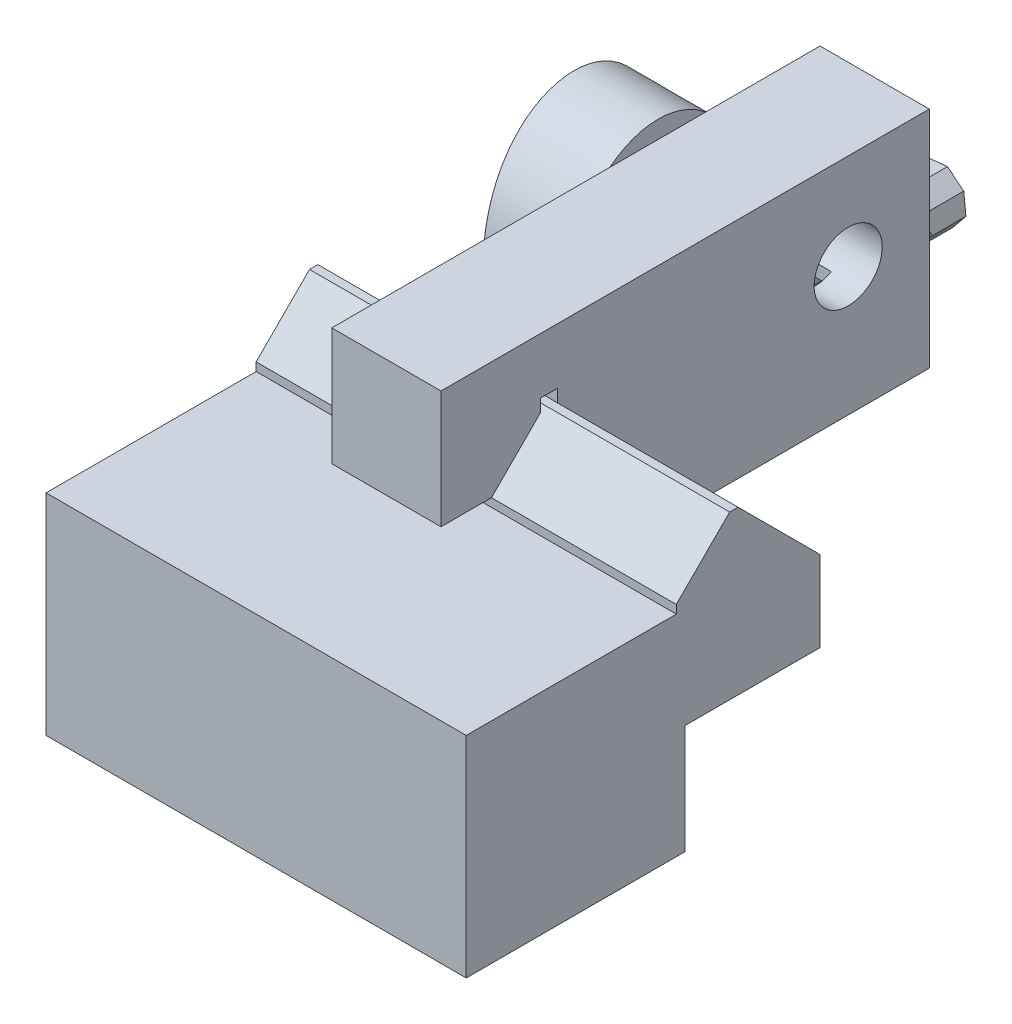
ISO-10303-21;
HEADER;
FILE_DESCRIPTION(('STEP AP214'),'2;1');
FILE_NAME('part.step','',(''),(''),'','','');
FILE_SCHEMA(('AUTOMOTIVE_DESIGN { 1 0 10303 214 1 1 1 1 }'));
ENDSEC;
DATA;
#1=APPLICATION_CONTEXT('core data for automotive mechanical design processes');
#2=APPLICATION_PROTOCOL_DEFINITION('international standard','automotive_design',2000,#1);
#3=PRODUCT_CONTEXT('',#1,'mechanical');
#4=PRODUCT('Part','Part','',(#3));
#5=PRODUCT_RELATED_PRODUCT_CATEGORY('part','',(#4));
#6=PRODUCT_DEFINITION_FORMATION('','',#4);
#7=PRODUCT_DEFINITION_CONTEXT('part definition',#1,'design');
#8=PRODUCT_DEFINITION('design','',#6,#7);
#9=PRODUCT_DEFINITION_SHAPE('','',#8);
#10=(LENGTH_UNIT() NAMED_UNIT(*) SI_UNIT(.MILLI.,.METRE.));
#11=(NAMED_UNIT(*) PLANE_ANGLE_UNIT() SI_UNIT($,.RADIAN.));
#12=(NAMED_UNIT(*) SI_UNIT($,.STERADIAN.) SOLID_ANGLE_UNIT());
#13=UNCERTAINTY_MEASURE_WITH_UNIT(LENGTH_MEASURE(1.E-05),#10,'distance_accuracy_value','');
#14=(GEOMETRIC_REPRESENTATION_CONTEXT(3) GLOBAL_UNCERTAINTY_ASSIGNED_CONTEXT((#13)) GLOBAL_UNIT_ASSIGNED_CONTEXT((#10,
#11,#12)) REPRESENTATION_CONTEXT('',''));
#15=CARTESIAN_POINT('',(0.,0.,0.));
#16=DIRECTION('',(0.,0.,1.));
#17=DIRECTION('',(1.,0.,0.));
#18=AXIS2_PLACEMENT_3D('',#15,#16,#17);
#19=CARTESIAN_POINT('',(0.,0.,-70.6019335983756));
#20=DIRECTION('',(0.,0.,-1.));
#21=DIRECTION('',(-1.,0.,0.));
#22=AXIS2_PLACEMENT_3D('',#19,#20,#21);
#23=PLANE('',#22);
#24=DIRECTION('',(0.629152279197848,0.777282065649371,0.));
#25=VECTOR('',#24,1.);
#26=CARTESIAN_POINT('',(6.13634358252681,10.4674114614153,-70.6019335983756));
#27=LINE('',#26,#25);
#28=CARTESIAN_POINT('',(7.67474765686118,12.3680227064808,-70.6019335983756));
#29=VERTEX_POINT('',#28);
#30=CARTESIAN_POINT('',(7.69996402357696,12.3991761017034,-70.6019335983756));
#31=VERTEX_POINT('',#30);
#32=EDGE_CURVE('E416',#29,#31,#27,.T.);
#33=ORIENTED_EDGE('',*,*,#32,.F.);
#34=CARTESIAN_POINT('',(9.25,9.5458369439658,-70.6019335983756));
#35=DIRECTION('',(0.,0.,-1.));
#36=DIRECTION('',(-1.,0.,0.));
#37=AXIS2_PLACEMENT_3D('',#34,#35,#36);
#38=CIRCLE('',#37,3.23205080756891);
#39=CARTESIAN_POINT('',(7.73982346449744,12.4033742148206,-70.6019335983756));
#40=VERTEX_POINT('',#39);
#41=EDGE_CURVE('E274',#29,#40,#38,.T.);
#42=ORIENTED_EDGE('',*,*,#41,.T.);
#43=DIRECTION('',(0.994499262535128,0.104743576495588,0.));
#44=VECTOR('',#43,1.);
#45=CARTESIAN_POINT('',(7.69996402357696,12.3991761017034,-70.6019335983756));
#46=LINE('',#45,#44);
#47=EDGE_CURVE('E375',#31,#40,#46,.T.);
#48=ORIENTED_EDGE('',*,*,#47,.F.);
#49=EDGE_LOOP('',(#33,#42,#48));
#50=FACE_BOUND('',#49,.T.);
#51=ADVANCED_FACE('F104',(#50),#23,.F.);
#52=CARTESIAN_POINT('',(10.131715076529,12.6552952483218,-70.6019335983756));
#53=VERTEX_POINT('',#52);
#54=CARTESIAN_POINT('',(10.1715745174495,12.659493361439,-70.6019335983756));
#55=VERTEX_POINT('',#54);
#56=EDGE_CURVE('E418',#53,#55,#46,.T.);
#57=ORIENTED_EDGE('',*,*,#56,.F.);
#58=CARTESIAN_POINT('',(9.25,9.5458369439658,-70.6019335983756));
#59=DIRECTION('',(0.,0.,-1.));
#60=DIRECTION('',(-1.,0.,0.));
#61=AXIS2_PLACEMENT_3D('',#58,#59,#60);
#62=CIRCLE('',#61,3.23205080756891);
#63=CARTESIAN_POINT('',(10.2027279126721,12.6342769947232,-70.6019335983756));
#64=VERTEX_POINT('',#63);
#65=EDGE_CURVE('E272',#53,#64,#62,.T.);
#66=ORIENTED_EDGE('',*,*,#65,.T.);
#67=DIRECTION('',(0.777282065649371,-0.629152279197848,0.));
#68=VECTOR('',#67,1.);
#69=CARTESIAN_POINT('',(10.1715745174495,12.659493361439,-70.6019335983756));
#70=LINE('',#69,#68);
#71=EDGE_CURVE('E367',#55,#64,#70,.T.);
#72=ORIENTED_EDGE('',*,*,#71,.F.);
#73=EDGE_LOOP('',(#57,#66,#72));
#74=FACE_BOUND('',#73,.T.);
#75=ADVANCED_FACE('F445',(#74),#23,.F.);
#76=CARTESIAN_POINT('',(12.072185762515,11.1210892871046,-70.6019335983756));
#77=VERTEX_POINT('',#76);
#78=CARTESIAN_POINT('',(12.1033391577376,11.0958729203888,-70.6019335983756));
#79=VERTEX_POINT('',#78);
#80=EDGE_CURVE('E363',#77,#79,#70,.T.);
#81=ORIENTED_EDGE('',*,*,#80,.F.);
#82=CARTESIAN_POINT('',(9.25,9.5458369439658,-70.6019335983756));
#83=DIRECTION('',(0.,0.,-1.));
#84=DIRECTION('',(-1.,0.,0.));
#85=AXIS2_PLACEMENT_3D('',#82,#83,#84);
#86=CIRCLE('',#85,3.23205080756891);
#87=CARTESIAN_POINT('',(12.1075372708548,11.0560134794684,-70.6019335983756));
#88=VERTEX_POINT('',#87);
#89=EDGE_CURVE('E270',#77,#88,#86,.T.);
#90=ORIENTED_EDGE('',*,*,#89,.T.);
#91=DIRECTION('',(0.104743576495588,-0.994499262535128,0.));
#92=VECTOR('',#91,1.);
#93=CARTESIAN_POINT('',(12.1033391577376,11.0958729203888,-70.6019335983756));
#94=LINE('',#93,#92);
#95=EDGE_CURVE('E374',#79,#88,#94,.T.);
#96=ORIENTED_EDGE('',*,*,#95,.F.);
#97=EDGE_LOOP('',(#81,#90,#96));
#98=FACE_BOUND('',#97,.T.);
#99=ADVANCED_FACE('F373',(#98),#23,.F.);
#100=CARTESIAN_POINT('',(12.359458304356,8.66412186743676,-70.6019335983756));
#101=VERTEX_POINT('',#100);
#102=CARTESIAN_POINT('',(12.3636564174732,8.6242624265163,-70.6019335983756));
#103=VERTEX_POINT('',#102);
#104=EDGE_CURVE('E385',#101,#103,#94,.T.);
#105=ORIENTED_EDGE('',*,*,#104,.F.);
#106=CARTESIAN_POINT('',(9.25,9.5458369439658,-70.6019335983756));
#107=DIRECTION('',(0.,0.,-1.));
#108=DIRECTION('',(-1.,0.,0.));
#109=AXIS2_PLACEMENT_3D('',#106,#107,#108);
#110=CIRCLE('',#109,3.23205080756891);
#111=CARTESIAN_POINT('',(12.3384400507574,8.59310903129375,-70.6019335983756));
#112=VERTEX_POINT('',#111);
#113=EDGE_CURVE('E268',#101,#112,#110,.T.);
#114=ORIENTED_EDGE('',*,*,#113,.T.);
#115=DIRECTION('',(-0.629152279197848,-0.777282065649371,0.));
#116=VECTOR('',#115,1.);
#117=CARTESIAN_POINT('',(12.3636564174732,8.6242624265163,-70.6019335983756));
#118=LINE('',#117,#116);
#119=EDGE_CURVE('E384',#103,#112,#118,.T.);
#120=ORIENTED_EDGE('',*,*,#119,.F.);
#121=EDGE_LOOP('',(#105,#114,#120));
#122=FACE_BOUND('',#121,.T.);
#123=ADVANCED_FACE('F383',(#122),#23,.F.);
#124=CARTESIAN_POINT('',(10.8252523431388,6.72365118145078,-70.6019335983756));
#125=VERTEX_POINT('',#124);
#126=CARTESIAN_POINT('',(10.800035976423,6.69249778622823,-70.6019335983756));
#127=VERTEX_POINT('',#126);
#128=EDGE_CURVE('E392',#125,#127,#118,.T.);
#129=ORIENTED_EDGE('',*,*,#128,.F.);
#130=CARTESIAN_POINT('',(9.25,9.5458369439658,-70.6019335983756));
#131=DIRECTION('',(0.,0.,-1.));
#132=DIRECTION('',(-1.,0.,0.));
#133=AXIS2_PLACEMENT_3D('',#130,#131,#132);
#134=CIRCLE('',#133,3.23205080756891);
#135=CARTESIAN_POINT('',(10.7601765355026,6.688299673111,-70.6019335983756));
#136=VERTEX_POINT('',#135);
#137=EDGE_CURVE('E266',#125,#136,#134,.T.);
#138=ORIENTED_EDGE('',*,*,#137,.T.);
#139=DIRECTION('',(-0.994499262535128,-0.104743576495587,0.));
#140=VECTOR('',#139,1.);
#141=CARTESIAN_POINT('',(10.800035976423,6.69249778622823,-70.6019335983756));
#142=LINE('',#141,#140);
#143=EDGE_CURVE('E242',#127,#136,#142,.T.);
#144=ORIENTED_EDGE('',*,*,#143,.F.);
#145=EDGE_LOOP('',(#129,#138,#144));
#146=FACE_BOUND('',#145,.T.);
#147=ADVANCED_FACE('F469',(#146),#23,.F.);
#148=CARTESIAN_POINT('',(8.36828492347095,6.43637863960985,-70.6019335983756));
#149=VERTEX_POINT('',#148);
#150=CARTESIAN_POINT('',(8.32842548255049,6.43218052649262,-70.6019335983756));
#151=VERTEX_POINT('',#150);
#152=EDGE_CURVE('E391',#149,#151,#142,.T.);
#153=ORIENTED_EDGE('',*,*,#152,.F.);
#154=CARTESIAN_POINT('',(9.25,9.5458369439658,-70.6019335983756));
#155=DIRECTION('',(0.,0.,-1.));
#156=DIRECTION('',(-1.,0.,0.));
#157=AXIS2_PLACEMENT_3D('',#154,#155,#156);
#158=CIRCLE('',#157,3.23205080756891);
#159=CARTESIAN_POINT('',(8.29727208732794,6.4573968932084,-70.6019335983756));
#160=VERTEX_POINT('',#159);
#161=EDGE_CURVE('E264',#149,#160,#158,.T.);
#162=ORIENTED_EDGE('',*,*,#161,.T.);
#163=DIRECTION('',(-0.777282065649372,0.629152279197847,0.));
#164=VECTOR('',#163,1.);
#165=CARTESIAN_POINT('',(8.32842548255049,6.43218052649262,-70.6019335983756));
#166=LINE('',#165,#164);
#167=EDGE_CURVE('E435',#151,#160,#166,.T.);
#168=ORIENTED_EDGE('',*,*,#167,.F.);
#169=EDGE_LOOP('',(#153,#162,#168));
#170=FACE_BOUND('',#169,.T.);
#171=ADVANCED_FACE('F462',(#170),#23,.F.);
#172=CARTESIAN_POINT('',(6.42781423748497,7.97058460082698,-70.6019335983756));
#173=VERTEX_POINT('',#172);
#174=CARTESIAN_POINT('',(6.39666084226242,7.99580096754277,-70.6019335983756));
#175=VERTEX_POINT('',#174);
#176=EDGE_CURVE('E246',#173,#175,#166,.T.);
#177=ORIENTED_EDGE('',*,*,#176,.F.);
#178=CARTESIAN_POINT('',(9.25,9.5458369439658,-70.6019335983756));
#179=DIRECTION('',(0.,0.,-1.));
#180=DIRECTION('',(-1.,0.,0.));
#181=AXIS2_PLACEMENT_3D('',#178,#179,#180);
#182=CIRCLE('',#181,3.23205080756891);
#183=CARTESIAN_POINT('',(6.39246272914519,8.03566040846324,-70.6019335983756));
#184=VERTEX_POINT('',#183);
#185=EDGE_CURVE('E133',#173,#184,#182,.T.);
#186=ORIENTED_EDGE('',*,*,#185,.T.);
#187=DIRECTION('',(-0.104743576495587,0.994499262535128,0.));
#188=VECTOR('',#187,1.);
#189=CARTESIAN_POINT('',(6.39666084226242,7.99580096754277,-70.6019335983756));
#190=LINE('',#189,#188);
#191=EDGE_CURVE('E437',#175,#184,#190,.T.);
#192=ORIENTED_EDGE('',*,*,#191,.F.);
#193=EDGE_LOOP('',(#177,#186,#192));
#194=FACE_BOUND('',#193,.T.);
#195=ADVANCED_FACE('F454',(#194),#23,.F.);
#196=CARTESIAN_POINT('',(9.25000000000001,9.84583694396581,-65.4372149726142));
#197=DIRECTION('',(0.,0.,1.));
#198=DIRECTION('',(1.,0.,0.));
#199=AXIS2_PLACEMENT_3D('',#196,#197,#198);
#200=CYLINDRICAL_SURFACE('',#199,3.);
#201=CARTESIAN_POINT('',(9.25,9.84583694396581,-53.2519335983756));
#202=DIRECTION('',(0.,0.,-1.));
#203=DIRECTION('',(-1.,0.,0.));
#204=AXIS2_PLACEMENT_3D('',#201,#202,#203);
#205=CIRCLE('',#204,3.);
#206=CARTESIAN_POINT('',(6.25,9.84583694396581,-53.2519335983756));
#207=VERTEX_POINT('',#206);
#208=EDGE_CURVE('E250',#207,#207,#205,.T.);
#209=ORIENTED_EDGE('',*,*,#208,.T.);
#210=EDGE_LOOP('',(#209));
#211=FACE_BOUND('',#210,.T.);
#212=CARTESIAN_POINT('',(9.25,9.84583694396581,-56.6519335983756));
#213=DIRECTION('',(0.,0.,-1.));
#214=DIRECTION('',(-1.,0.,0.));
#215=AXIS2_PLACEMENT_3D('',#212,#213,#214);
#216=CIRCLE('',#215,3.);
#217=CARTESIAN_POINT('',(6.25,9.84583694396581,-56.6519335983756));
#218=VERTEX_POINT('',#217);
#219=EDGE_CURVE('E256',#218,#218,#216,.T.);
#220=ORIENTED_EDGE('',*,*,#219,.F.);
#221=EDGE_LOOP('',(#220));
#222=FACE_BOUND('',#221,.T.);
#223=ADVANCED_FACE('F461',(#211,#222),#200,.T.);
#224=CARTESIAN_POINT('',(9.25,9.84583694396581,-53.2519335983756));
#225=DIRECTION('',(0.,0.,-1.));
#226=DIRECTION('',(-1.,0.,0.));
#227=AXIS2_PLACEMENT_3D('',#224,#225,#226);
#228=PLANE('',#227);
#229=ORIENTED_EDGE('',*,*,#208,.F.);
#230=EDGE_LOOP('',(#229));
#231=FACE_BOUND('',#230,.T.);
#232=ADVANCED_FACE('F467',(#231),#228,.F.);
#233=CARTESIAN_POINT('',(14.,27.501,-56.6519335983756));
#234=DIRECTION('',(0.,0.,-1.));
#235=DIRECTION('',(-1.,0.,0.));
#236=AXIS2_PLACEMENT_3D('',#233,#234,#235);
#237=PLANE('',#236);
#238=CARTESIAN_POINT('',(9.25,9.5458369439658,-56.6519335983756));
#239=DIRECTION('',(0.,0.,-1.));
#240=DIRECTION('',(-1.,0.,0.));
#241=AXIS2_PLACEMENT_3D('',#238,#239,#240);
#242=CIRCLE('',#241,1.5);
#243=CARTESIAN_POINT('',(7.75,9.5458369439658,-56.6519335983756));
#244=VERTEX_POINT('',#243);
#245=EDGE_CURVE('E247',#244,#244,#242,.T.);
#246=ORIENTED_EDGE('',*,*,#245,.F.);
#247=EDGE_LOOP('',(#246));
#248=FACE_BOUND('',#247,.T.);
#249=ORIENTED_EDGE('',*,*,#219,.T.);
#250=EDGE_LOOP('',(#249));
#251=FACE_BOUND('',#250,.T.);
#252=ADVANCED_FACE('F515',(#248,#251),#237,.T.);
#253=CARTESIAN_POINT('',(9.25,9.5458369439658,-80.8445742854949));
#254=DIRECTION('',(0.,0.,1.));
#255=DIRECTION('',(1.,0.,0.));
#256=AXIS2_PLACEMENT_3D('',#253,#254,#255);
#257=CYLINDRICAL_SURFACE('',#256,1.5);
#258=CARTESIAN_POINT('',(9.25,9.5458369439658,-67.6019335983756));
#259=DIRECTION('',(0.,0.,-1.));
#260=DIRECTION('',(-1.,0.,0.));
#261=AXIS2_PLACEMENT_3D('',#258,#259,#260);
#262=CIRCLE('',#261,1.5);
#263=CARTESIAN_POINT('',(7.75,9.5458369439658,-67.6019335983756));
#264=VERTEX_POINT('',#263);
#265=EDGE_CURVE('E277',#264,#264,#262,.F.);
#266=ORIENTED_EDGE('',*,*,#265,.T.);
#267=EDGE_LOOP('',(#266));
#268=FACE_BOUND('',#267,.T.);
#269=ORIENTED_EDGE('',*,*,#245,.T.);
#270=EDGE_LOOP('',(#269));
#271=FACE_BOUND('',#270,.T.);
#272=ADVANCED_FACE('F527',(#268,#271),#257,.T.);
#273=CARTESIAN_POINT('',(8.32842548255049,6.43218052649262,-74.6019335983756));
#274=DIRECTION('',(0.629152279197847,0.777282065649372,0.));
#275=DIRECTION('',(-0.777282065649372,0.629152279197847,0.));
#276=AXIS2_PLACEMENT_3D('',#273,#274,#275);
#277=PLANE('',#276);
#278=ORIENTED_EDGE('',*,*,#167,.T.);
#279=CARTESIAN_POINT('',(8.29727208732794,6.4573968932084,-70.6019335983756));
#280=CARTESIAN_POINT('',(8.21172420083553,6.52664157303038,-70.5309933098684));
#281=CARTESIAN_POINT('',(8.12252086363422,6.59884506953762,-70.4654166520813));
#282=CARTESIAN_POINT('',(7.9365467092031,6.74937737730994,-70.3513754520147));
#283=CARTESIAN_POINT('',(7.83969845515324,6.82776886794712,-70.3031238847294));
#284=CARTESIAN_POINT('',(7.66390283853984,6.97006240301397,-70.2405639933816));
#285=CARTESIAN_POINT('',(7.58615694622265,7.03299194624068,-70.2209197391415));
#286=CARTESIAN_POINT('',(7.42966019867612,7.15966447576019,-70.1992733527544));
#287=CARTESIAN_POINT('',(7.35091926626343,7.22339943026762,-70.1971564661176));
#288=CARTESIAN_POINT('',(7.19443818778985,7.35005927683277,-70.2105774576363));
#289=CARTESIAN_POINT('',(7.11669746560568,7.41298463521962,-70.226104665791));
#290=CARTESIAN_POINT('',(6.96368851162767,7.53683405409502,-70.2727423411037));
#291=CARTESIAN_POINT('',(6.88843839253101,7.59774345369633,-70.3039479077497));
#292=CARTESIAN_POINT('',(6.74687943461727,7.71232494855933,-70.3760166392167));
#293=CARTESIAN_POINT('',(6.68031161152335,7.76620667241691,-70.4160678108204));
#294=CARTESIAN_POINT('',(6.55125777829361,7.87066619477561,-70.5038432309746));
#295=CARTESIAN_POINT('',(6.48873353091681,7.92127494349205,-70.551473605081));
#296=CARTESIAN_POINT('',(6.42781423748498,7.97058460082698,-70.6019335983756));
#297=B_SPLINE_CURVE_WITH_KNOTS('',3,(#279,#280,#281,#282,#283,#284,#285,#286,#287,#288,#289,
#290,#291,#292,#293,#294,#295,#296),.UNSPECIFIED.,.F.,.F.,(4,2,2,2,2,2,2,2,4),(0.,
0.394319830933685,0.793333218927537,1.09772187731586,1.40011606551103,1.70232748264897,
2.00639454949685,2.28954527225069,2.56942865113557),.UNSPECIFIED.);
#298=EDGE_CURVE('E316',#160,#173,#297,.T.);
#299=ORIENTED_EDGE('',*,*,#298,.T.);
#300=ORIENTED_EDGE('',*,*,#176,.T.);
#301=DIRECTION('',(0.,0.,1.));
#302=VECTOR('',#301,1.);
#303=CARTESIAN_POINT('',(6.39666084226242,7.99580096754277,-74.6019335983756));
#304=LINE('',#303,#302);
#305=CARTESIAN_POINT('',(6.39666084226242,7.99580096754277,-74.6019335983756));
#306=VERTEX_POINT('',#305);
#307=EDGE_CURVE('E227',#306,#175,#304,.T.);
#308=ORIENTED_EDGE('',*,*,#307,.F.);
#309=DIRECTION('',(-0.777282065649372,0.629152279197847,0.));
#310=VECTOR('',#309,1.);
#311=CARTESIAN_POINT('',(8.32842548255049,6.43218052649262,-74.6019335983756));
#312=LINE('',#311,#310);
#313=CARTESIAN_POINT('',(8.32842548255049,6.43218052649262,-74.6019335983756));
#314=VERTEX_POINT('',#313);
#315=EDGE_CURVE('E233',#314,#306,#312,.T.);
#316=ORIENTED_EDGE('',*,*,#315,.F.);
#317=DIRECTION('',(0.,0.,1.));
#318=VECTOR('',#317,1.);
#319=CARTESIAN_POINT('',(8.32842548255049,6.43218052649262,-74.6019335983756));
#320=LINE('',#319,#318);
#321=EDGE_CURVE('E398',#314,#151,#320,.T.);
#322=ORIENTED_EDGE('',*,*,#321,.T.);
#323=EDGE_LOOP('',(#278,#299,#300,#308,#316,#322));
#324=FACE_BOUND('',#323,.T.);
#325=ADVANCED_FACE('F245',(#324),#277,.F.);
#326=CARTESIAN_POINT('',(6.39666084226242,7.99580096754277,-74.6019335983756));
#327=DIRECTION('',(0.994499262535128,0.104743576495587,0.));
#328=DIRECTION('',(-0.104743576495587,0.994499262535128,0.));
#329=AXIS2_PLACEMENT_3D('',#326,#327,#328);
#330=PLANE('',#329);
#331=ORIENTED_EDGE('',*,*,#191,.T.);
#332=CARTESIAN_POINT('',(6.39246272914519,8.03566040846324,-70.6019335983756));
#333=CARTESIAN_POINT('',(6.38093462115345,8.14511528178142,-70.5309933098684));
#334=CARTESIAN_POINT('',(6.36891391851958,8.25924714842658,-70.4654166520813));
#335=CARTESIAN_POINT('',(6.34385274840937,8.49719314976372,-70.3513754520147));
#336=CARTESIAN_POINT('',(6.33080184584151,8.62110636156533,-70.3031238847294));
#337=CARTESIAN_POINT('',(6.30711229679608,8.84602935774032,-70.2405639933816));
#338=CARTESIAN_POINT('',(6.29663555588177,8.94550191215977,-70.2209197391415));
#339=CARTESIAN_POINT('',(6.27554664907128,9.14573282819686,-70.1992733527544));
#340=CARTESIAN_POINT('',(6.26493582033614,9.24647849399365,-70.1971564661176));
#341=CARTESIAN_POINT('',(6.24384902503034,9.44668936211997,-70.2105774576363));
#342=CARTESIAN_POINT('',(6.23337298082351,9.54615530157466,-70.226104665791));
#343=CARTESIAN_POINT('',(6.21275407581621,9.74192373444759,-70.2727423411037));
#344=CARTESIAN_POINT('',(6.20261365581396,9.83820305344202,-70.3039479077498));
#345=CARTESIAN_POINT('',(6.18353770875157,10.0193217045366,-70.3760166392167));
#346=CARTESIAN_POINT('',(6.17456728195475,10.1044923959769,-70.4160678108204));
#347=CARTESIAN_POINT('',(6.15717647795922,10.2696112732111,-70.5038432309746));
#348=CARTESIAN_POINT('',(6.14875094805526,10.3496083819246,-70.551473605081));
#349=CARTESIAN_POINT('',(6.14054169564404,10.4275520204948,-70.6019335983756));
#350=B_SPLINE_CURVE_WITH_KNOTS('',3,(#332,#333,#334,#335,#336,#337,#338,#339,#340,#341,#342,
#343,#344,#345,#346,#347,#348,#349),.UNSPECIFIED.,.F.,.F.,(4,2,2,2,2,2,2,2,4),(0.,
0.394319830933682,0.793333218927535,1.09772187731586,1.40011606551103,1.70232748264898,
2.00639454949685,2.2895452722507,2.56942865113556),.UNSPECIFIED.);
#351=CARTESIAN_POINT('',(6.14054169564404,10.4275520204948,-70.6019335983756));
#352=VERTEX_POINT('',#351);
#353=EDGE_CURVE('E119',#184,#352,#350,.T.);
#354=ORIENTED_EDGE('',*,*,#353,.T.);
#355=CARTESIAN_POINT('',(6.13634358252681,10.4674114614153,-70.6019335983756));
#356=VERTEX_POINT('',#355);
#357=EDGE_CURVE('E436',#352,#356,#190,.T.);
#358=ORIENTED_EDGE('',*,*,#357,.T.);
#359=DIRECTION('',(0.,0.,1.));
#360=VECTOR('',#359,1.);
#361=CARTESIAN_POINT('',(6.13634358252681,10.4674114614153,-74.6019335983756));
#362=LINE('',#361,#360);
#363=CARTESIAN_POINT('',(6.13634358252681,10.4674114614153,-74.6019335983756));
#364=VERTEX_POINT('',#363);
#365=EDGE_CURVE('E229',#364,#356,#362,.T.);
#366=ORIENTED_EDGE('',*,*,#365,.F.);
#367=DIRECTION('',(-0.104743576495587,0.994499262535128,0.));
#368=VECTOR('',#367,1.);
#369=CARTESIAN_POINT('',(6.39666084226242,7.99580096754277,-74.6019335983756));
#370=LINE('',#369,#368);
#371=EDGE_CURVE('E223',#306,#364,#370,.T.);
#372=ORIENTED_EDGE('',*,*,#371,.F.);
#373=ORIENTED_EDGE('',*,*,#307,.T.);
#374=EDGE_LOOP('',(#331,#354,#358,#366,#372,#373));
#375=FACE_BOUND('',#374,.T.);
#376=ADVANCED_FACE('F225',(#375),#330,.F.);
#377=CARTESIAN_POINT('',(6.13634358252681,10.4674114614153,-74.6019335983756));
#378=DIRECTION('',(0.777282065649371,-0.629152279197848,0.));
#379=DIRECTION('',(0.629152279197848,0.777282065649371,0.));
#380=AXIS2_PLACEMENT_3D('',#377,#378,#379);
#381=PLANE('',#380);
#382=CARTESIAN_POINT('',(6.1615599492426,10.4985648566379,-70.6019335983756));
#383=VERTEX_POINT('',#382);
#384=EDGE_CURVE('E420',#356,#383,#27,.T.);
#385=ORIENTED_EDGE('',*,*,#384,.T.);
#386=CARTESIAN_POINT('',(6.1615599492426,10.4985648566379,-70.6019335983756));
#387=CARTESIAN_POINT('',(6.23080462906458,10.5841127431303,-70.5309933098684));
#388=CARTESIAN_POINT('',(6.30300812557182,10.6733160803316,-70.4654166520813));
#389=CARTESIAN_POINT('',(6.45354043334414,10.8592902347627,-70.3513754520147));
#390=CARTESIAN_POINT('',(6.53193192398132,10.9561384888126,-70.3031238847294));
#391=CARTESIAN_POINT('',(6.67422545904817,11.131934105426,-70.2405639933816));
#392=CARTESIAN_POINT('',(6.73715500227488,11.2096799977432,-70.2209197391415));
#393=CARTESIAN_POINT('',(6.86382753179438,11.3661767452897,-70.1992733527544));
#394=CARTESIAN_POINT('',(6.92756248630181,11.4449176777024,-70.1971564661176));
#395=CARTESIAN_POINT('',(7.05422233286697,11.601398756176,-70.2105774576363));
#396=CARTESIAN_POINT('',(7.11714769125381,11.6791394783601,-70.226104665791));
#397=CARTESIAN_POINT('',(7.24099711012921,11.8321484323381,-70.2727423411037));
#398=CARTESIAN_POINT('',(7.30190650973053,11.9073985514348,-70.3039479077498));
#399=CARTESIAN_POINT('',(7.41648800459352,12.0489575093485,-70.3760166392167));
#400=CARTESIAN_POINT('',(7.47036972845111,12.1155253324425,-70.4160678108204));
#401=CARTESIAN_POINT('',(7.5748292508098,12.2445791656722,-70.5038432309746));
#402=CARTESIAN_POINT('',(7.62543799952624,12.307103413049,-70.551473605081));
#403=CARTESIAN_POINT('',(7.67474765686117,12.3680227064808,-70.6019335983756));
#404=B_SPLINE_CURVE_WITH_KNOTS('',3,(#386,#387,#388,#389,#390,#391,#392,#393,#394,#395,#396,
#397,#398,#399,#400,#401,#402,#403),.UNSPECIFIED.,.F.,.F.,(4,2,2,2,2,2,2,2,4),(0.,
0.394319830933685,0.793333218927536,1.09772187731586,1.40011606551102,1.70232748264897,
2.00639454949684,2.28954527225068,2.56942865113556),.UNSPECIFIED.);
#405=EDGE_CURVE('E14',#383,#29,#404,.T.);
#406=ORIENTED_EDGE('',*,*,#405,.T.);
#407=ORIENTED_EDGE('',*,*,#32,.T.);
#408=DIRECTION('',(0.,0.,1.));
#409=VECTOR('',#408,1.);
#410=CARTESIAN_POINT('',(7.69996402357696,12.3991761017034,-74.6019335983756));
#411=LINE('',#410,#409);
#412=CARTESIAN_POINT('',(7.69996402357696,12.3991761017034,-74.6019335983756));
#413=VERTEX_POINT('',#412);
#414=EDGE_CURVE('E252',#413,#31,#411,.T.);
#415=ORIENTED_EDGE('',*,*,#414,.F.);
#416=DIRECTION('',(0.629152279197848,0.777282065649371,0.));
#417=VECTOR('',#416,1.);
#418=CARTESIAN_POINT('',(6.13634358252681,10.4674114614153,-74.6019335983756));
#419=LINE('',#418,#417);
#420=EDGE_CURVE('E232',#364,#413,#419,.T.);
#421=ORIENTED_EDGE('',*,*,#420,.F.);
#422=ORIENTED_EDGE('',*,*,#365,.T.);
#423=EDGE_LOOP('',(#385,#406,#407,#415,#421,#422));
#424=FACE_BOUND('',#423,.T.);
#425=ADVANCED_FACE('F298',(#424),#381,.F.);
#426=CARTESIAN_POINT('',(7.69996402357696,12.3991761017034,-74.6019335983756));
#427=DIRECTION('',(0.104743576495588,-0.994499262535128,0.));
#428=DIRECTION('',(0.994499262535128,0.104743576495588,0.));
#429=AXIS2_PLACEMENT_3D('',#426,#427,#428);
#430=PLANE('',#429);
#431=ORIENTED_EDGE('',*,*,#47,.T.);
#432=CARTESIAN_POINT('',(7.73982346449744,12.4033742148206,-70.6019335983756));
#433=CARTESIAN_POINT('',(7.84927833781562,12.4149023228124,-70.5309933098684));
#434=CARTESIAN_POINT('',(7.96341020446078,12.4269230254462,-70.4654166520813));
#435=CARTESIAN_POINT('',(8.20135620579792,12.4519841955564,-70.3513754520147));
#436=CARTESIAN_POINT('',(8.32526941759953,12.4650350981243,-70.3031238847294));
#437=CARTESIAN_POINT('',(8.55019241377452,12.4887246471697,-70.2405639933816));
#438=CARTESIAN_POINT('',(8.64966496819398,12.499201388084,-70.2209197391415));
#439=CARTESIAN_POINT('',(8.84989588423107,12.5202902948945,-70.1992733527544));
#440=CARTESIAN_POINT('',(8.95064155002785,12.5309011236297,-70.1971564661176));
#441=CARTESIAN_POINT('',(9.15085241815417,12.5519879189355,-70.2105774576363));
#442=CARTESIAN_POINT('',(9.25031835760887,12.5624639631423,-70.226104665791));
#443=CARTESIAN_POINT('',(9.44608679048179,12.5830828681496,-70.2727423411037));
#444=CARTESIAN_POINT('',(9.54236610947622,12.5932232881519,-70.3039479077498));
#445=CARTESIAN_POINT('',(9.72348476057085,12.6122992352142,-70.3760166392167));
#446=CARTESIAN_POINT('',(9.80865545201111,12.6212696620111,-70.4160678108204));
#447=CARTESIAN_POINT('',(9.97377432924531,12.6386604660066,-70.5038432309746));
#448=CARTESIAN_POINT('',(10.0537714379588,12.6470859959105,-70.551473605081));
#449=CARTESIAN_POINT('',(10.131715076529,12.6552952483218,-70.6019335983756));
#450=B_SPLINE_CURVE_WITH_KNOTS('',3,(#432,#433,#434,#435,#436,#437,#438,#439,#440,#441,#442,
#443,#444,#445,#446,#447,#448,#449),.UNSPECIFIED.,.F.,.F.,(4,2,2,2,2,2,2,2,4),(0.,
0.394319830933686,0.793333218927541,1.09772187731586,1.40011606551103,1.70232748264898,
2.00639454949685,2.28954527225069,2.56942865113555),.UNSPECIFIED.);
#451=EDGE_CURVE('E280',#40,#53,#450,.T.);
#452=ORIENTED_EDGE('',*,*,#451,.T.);
#453=ORIENTED_EDGE('',*,*,#56,.T.);
#454=DIRECTION('',(0.,0.,1.));
#455=VECTOR('',#454,1.);
#456=CARTESIAN_POINT('',(10.1715745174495,12.659493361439,-74.6019335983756));
#457=LINE('',#456,#455);
#458=CARTESIAN_POINT('',(10.1715745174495,12.659493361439,-74.6019335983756));
#459=VERTEX_POINT('',#458);
#460=EDGE_CURVE('E406',#459,#55,#457,.T.);
#461=ORIENTED_EDGE('',*,*,#460,.F.);
#462=DIRECTION('',(0.994499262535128,0.104743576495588,0.));
#463=VECTOR('',#462,1.);
#464=CARTESIAN_POINT('',(7.69996402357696,12.3991761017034,-74.6019335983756));
#465=LINE('',#464,#463);
#466=EDGE_CURVE('E413',#413,#459,#465,.T.);
#467=ORIENTED_EDGE('',*,*,#466,.F.);
#468=ORIENTED_EDGE('',*,*,#414,.T.);
#469=EDGE_LOOP('',(#431,#452,#453,#461,#467,#468));
#470=FACE_BOUND('',#469,.T.);
#471=ADVANCED_FACE('F294',(#470),#430,.F.);
#472=CARTESIAN_POINT('',(10.1715745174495,12.659493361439,-74.6019335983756));
#473=DIRECTION('',(-0.629152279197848,-0.777282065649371,0.));
#474=DIRECTION('',(0.777282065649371,-0.629152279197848,0.));
#475=AXIS2_PLACEMENT_3D('',#472,#473,#474);
#476=PLANE('',#475);
#477=ORIENTED_EDGE('',*,*,#71,.T.);
#478=CARTESIAN_POINT('',(10.2027279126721,12.6342769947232,-70.6019335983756));
#479=CARTESIAN_POINT('',(10.2882757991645,12.5650323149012,-70.5309933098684));
#480=CARTESIAN_POINT('',(10.3774791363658,12.492828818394,-70.4654166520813));
#481=CARTESIAN_POINT('',(10.5634532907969,12.3422965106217,-70.3513754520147));
#482=CARTESIAN_POINT('',(10.6603015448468,12.2639050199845,-70.3031238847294));
#483=CARTESIAN_POINT('',(10.8360971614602,12.1216114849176,-70.2405639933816));
#484=CARTESIAN_POINT('',(10.9138430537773,12.0586819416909,-70.2209197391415));
#485=CARTESIAN_POINT('',(11.0703398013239,11.9320094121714,-70.1992733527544));
#486=CARTESIAN_POINT('',(11.1490807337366,11.868274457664,-70.1971564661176));
#487=CARTESIAN_POINT('',(11.3055618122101,11.7416146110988,-70.2105774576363));
#488=CARTESIAN_POINT('',(11.3833025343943,11.678689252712,-70.226104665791));
#489=CARTESIAN_POINT('',(11.5363114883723,11.5548398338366,-70.2727423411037));
#490=CARTESIAN_POINT('',(11.611561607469,11.4939304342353,-70.3039479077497));
#491=CARTESIAN_POINT('',(11.7531205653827,11.3793489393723,-70.3760166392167));
#492=CARTESIAN_POINT('',(11.8196883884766,11.3254672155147,-70.4160678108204));
#493=CARTESIAN_POINT('',(11.9487422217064,11.221007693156,-70.5038432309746));
#494=CARTESIAN_POINT('',(12.0112664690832,11.1703989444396,-70.551473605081));
#495=CARTESIAN_POINT('',(12.072185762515,11.1210892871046,-70.6019335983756));
#496=B_SPLINE_CURVE_WITH_KNOTS('',3,(#478,#479,#480,#481,#482,#483,#484,#485,#486,#487,#488,
#489,#490,#491,#492,#493,#494,#495),.UNSPECIFIED.,.F.,.F.,(4,2,2,2,2,2,2,2,4),(0.,
0.394319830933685,0.793333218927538,1.09772187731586,1.40011606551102,1.70232748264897,
2.00639454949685,2.28954527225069,2.56942865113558),.UNSPECIFIED.);
#497=EDGE_CURVE('E287',#64,#77,#496,.T.);
#498=ORIENTED_EDGE('',*,*,#497,.T.);
#499=ORIENTED_EDGE('',*,*,#80,.T.);
#500=DIRECTION('',(0.,0.,1.));
#501=VECTOR('',#500,1.);
#502=CARTESIAN_POINT('',(12.1033391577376,11.0958729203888,-74.6019335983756));
#503=LINE('',#502,#501);
#504=CARTESIAN_POINT('',(12.1033391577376,11.0958729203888,-74.6019335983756));
#505=VERTEX_POINT('',#504);
#506=EDGE_CURVE('E404',#505,#79,#503,.T.);
#507=ORIENTED_EDGE('',*,*,#506,.F.);
#508=DIRECTION('',(0.777282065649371,-0.629152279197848,0.));
#509=VECTOR('',#508,1.);
#510=CARTESIAN_POINT('',(10.1715745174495,12.659493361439,-74.6019335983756));
#511=LINE('',#510,#509);
#512=EDGE_CURVE('E426',#459,#505,#511,.T.);
#513=ORIENTED_EDGE('',*,*,#512,.F.);
#514=ORIENTED_EDGE('',*,*,#460,.T.);
#515=EDGE_LOOP('',(#477,#498,#499,#507,#513,#514));
#516=FACE_BOUND('',#515,.T.);
#517=ADVANCED_FACE('F297',(#516),#476,.F.);
#518=CARTESIAN_POINT('',(12.1033391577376,11.0958729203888,-74.6019335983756));
#519=DIRECTION('',(-0.994499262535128,-0.104743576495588,0.));
#520=DIRECTION('',(0.104743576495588,-0.994499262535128,0.));
#521=AXIS2_PLACEMENT_3D('',#518,#519,#520);
#522=PLANE('',#521);
#523=ORIENTED_EDGE('',*,*,#95,.T.);
#524=CARTESIAN_POINT('',(12.1075372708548,11.0560134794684,-70.6019335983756));
#525=CARTESIAN_POINT('',(12.1190653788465,10.9465586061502,-70.5309933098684));
#526=CARTESIAN_POINT('',(12.1310860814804,10.832426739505,-70.4654166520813));
#527=CARTESIAN_POINT('',(12.1561472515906,10.5944807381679,-70.3513754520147));
#528=CARTESIAN_POINT('',(12.1691981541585,10.4705675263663,-70.3031238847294));
#529=CARTESIAN_POINT('',(12.1928877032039,10.2456445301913,-70.2405639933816));
#530=CARTESIAN_POINT('',(12.2033644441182,10.1461719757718,-70.2209197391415));
#531=CARTESIAN_POINT('',(12.2244533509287,9.94594105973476,-70.1992733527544));
#532=CARTESIAN_POINT('',(12.2350641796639,9.84519539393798,-70.1971564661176));
#533=CARTESIAN_POINT('',(12.2561509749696,9.64498452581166,-70.2105774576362));
#534=CARTESIAN_POINT('',(12.2666270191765,9.54551858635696,-70.226104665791));
#535=CARTESIAN_POINT('',(12.2872459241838,9.34975015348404,-70.2727423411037));
#536=CARTESIAN_POINT('',(12.297386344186,9.25347083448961,-70.3039479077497));
#537=CARTESIAN_POINT('',(12.3164622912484,9.07235218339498,-70.3760166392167));
#538=CARTESIAN_POINT('',(12.3254327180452,8.98718149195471,-70.4160678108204));
#539=CARTESIAN_POINT('',(12.3428235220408,8.8220626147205,-70.5038432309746));
#540=CARTESIAN_POINT('',(12.3512490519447,8.74206550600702,-70.551473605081));
#541=CARTESIAN_POINT('',(12.359458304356,8.66412186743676,-70.6019335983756));
#542=B_SPLINE_CURVE_WITH_KNOTS('',3,(#524,#525,#526,#527,#528,#529,#530,#531,#532,#533,#534,
#535,#536,#537,#538,#539,#540,#541),.UNSPECIFIED.,.F.,.F.,(4,2,2,2,2,2,2,2,4),(0.,
0.394319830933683,0.793333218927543,1.09772187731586,1.40011606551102,1.70232748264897,
2.00639454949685,2.2895452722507,2.56942865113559),.UNSPECIFIED.);
#543=EDGE_CURVE('E350',#88,#101,#542,.T.);
#544=ORIENTED_EDGE('',*,*,#543,.T.);
#545=ORIENTED_EDGE('',*,*,#104,.T.);
#546=DIRECTION('',(0.,0.,1.));
#547=VECTOR('',#546,1.);
#548=CARTESIAN_POINT('',(12.3636564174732,8.6242624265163,-74.6019335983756));
#549=LINE('',#548,#547);
#550=CARTESIAN_POINT('',(12.3636564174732,8.6242624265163,-74.6019335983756));
#551=VERTEX_POINT('',#550);
#552=EDGE_CURVE('E390',#551,#103,#549,.T.);
#553=ORIENTED_EDGE('',*,*,#552,.F.);
#554=DIRECTION('',(0.104743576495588,-0.994499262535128,0.));
#555=VECTOR('',#554,1.);
#556=CARTESIAN_POINT('',(12.1033391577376,11.0958729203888,-74.6019335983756));
#557=LINE('',#556,#555);
#558=EDGE_CURVE('E424',#505,#551,#557,.T.);
#559=ORIENTED_EDGE('',*,*,#558,.F.);
#560=ORIENTED_EDGE('',*,*,#506,.T.);
#561=EDGE_LOOP('',(#523,#544,#545,#553,#559,#560));
#562=FACE_BOUND('',#561,.T.);
#563=ADVANCED_FACE('F345',(#562),#522,.F.);
#564=CARTESIAN_POINT('',(12.3636564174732,8.6242624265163,-74.6019335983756));
#565=DIRECTION('',(-0.777282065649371,0.629152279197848,0.));
#566=DIRECTION('',(-0.629152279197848,-0.777282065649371,0.));
#567=AXIS2_PLACEMENT_3D('',#564,#565,#566);
#568=PLANE('',#567);
#569=ORIENTED_EDGE('',*,*,#119,.T.);
#570=CARTESIAN_POINT('',(12.3384400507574,8.59310903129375,-70.6019335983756));
#571=CARTESIAN_POINT('',(12.2691953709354,8.50756114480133,-70.5309933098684));
#572=CARTESIAN_POINT('',(12.1969918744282,8.41835780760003,-70.4654166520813));
#573=CARTESIAN_POINT('',(12.0464595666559,8.23238365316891,-70.3513754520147));
#574=CARTESIAN_POINT('',(11.9680680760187,8.13553539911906,-70.3031238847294));
#575=CARTESIAN_POINT('',(11.8257745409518,7.95973978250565,-70.2405639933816));
#576=CARTESIAN_POINT('',(11.7628449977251,7.88199389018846,-70.2209197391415));
#577=CARTESIAN_POINT('',(11.6361724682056,7.72549714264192,-70.1992733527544));
#578=CARTESIAN_POINT('',(11.5724375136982,7.64675621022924,-70.1971564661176));
#579=CARTESIAN_POINT('',(11.445777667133,7.49027513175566,-70.2105774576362));
#580=CARTESIAN_POINT('',(11.3828523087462,7.41253440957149,-70.226104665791));
#581=CARTESIAN_POINT('',(11.2590028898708,7.25952545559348,-70.2727423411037));
#582=CARTESIAN_POINT('',(11.1980934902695,7.18427533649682,-70.3039479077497));
#583=CARTESIAN_POINT('',(11.0835119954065,7.04271637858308,-70.3760166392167));
#584=CARTESIAN_POINT('',(11.0296302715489,6.97614855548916,-70.4160678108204));
#585=CARTESIAN_POINT('',(10.9251707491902,6.84709472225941,-70.5038432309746));
#586=CARTESIAN_POINT('',(10.8745620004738,6.78457047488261,-70.551473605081));
#587=CARTESIAN_POINT('',(10.8252523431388,6.72365118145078,-70.6019335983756));
#588=B_SPLINE_CURVE_WITH_KNOTS('',3,(#570,#571,#572,#573,#574,#575,#576,#577,#578,#579,#580,
#581,#582,#583,#584,#585,#586,#587),.UNSPECIFIED.,.F.,.F.,(4,2,2,2,2,2,2,2,4),(0.,
0.394319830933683,0.793333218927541,1.09772187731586,1.40011606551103,1.70232748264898,
2.00639454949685,2.2895452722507,2.56942865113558),.UNSPECIFIED.);
#589=EDGE_CURVE('E329',#112,#125,#588,.T.);
#590=ORIENTED_EDGE('',*,*,#589,.T.);
#591=ORIENTED_EDGE('',*,*,#128,.T.);
#592=DIRECTION('',(0.,0.,1.));
#593=VECTOR('',#592,1.);
#594=CARTESIAN_POINT('',(10.800035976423,6.69249778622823,-74.6019335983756));
#595=LINE('',#594,#593);
#596=CARTESIAN_POINT('',(10.800035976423,6.69249778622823,-74.6019335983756));
#597=VERTEX_POINT('',#596);
#598=EDGE_CURVE('E400',#597,#127,#595,.T.);
#599=ORIENTED_EDGE('',*,*,#598,.F.);
#600=DIRECTION('',(-0.629152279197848,-0.777282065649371,0.));
#601=VECTOR('',#600,1.);
#602=CARTESIAN_POINT('',(12.3636564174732,8.6242624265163,-74.6019335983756));
#603=LINE('',#602,#601);
#604=EDGE_CURVE('E428',#551,#597,#603,.T.);
#605=ORIENTED_EDGE('',*,*,#604,.F.);
#606=ORIENTED_EDGE('',*,*,#552,.T.);
#607=EDGE_LOOP('',(#569,#590,#591,#599,#605,#606));
#608=FACE_BOUND('',#607,.T.);
#609=ADVANCED_FACE('F339',(#608),#568,.F.);
#610=CARTESIAN_POINT('',(10.800035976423,6.69249778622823,-74.6019335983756));
#611=DIRECTION('',(-0.104743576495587,0.994499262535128,0.));
#612=DIRECTION('',(-0.994499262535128,-0.104743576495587,0.));
#613=AXIS2_PLACEMENT_3D('',#610,#611,#612);
#614=PLANE('',#613);
#615=ORIENTED_EDGE('',*,*,#143,.T.);
#616=CARTESIAN_POINT('',(10.7601765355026,6.688299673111,-70.6019335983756));
#617=CARTESIAN_POINT('',(10.6507216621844,6.67677156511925,-70.5309933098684));
#618=CARTESIAN_POINT('',(10.5365897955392,6.66475086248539,-70.4654166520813));
#619=CARTESIAN_POINT('',(10.2986437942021,6.63968969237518,-70.3513754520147));
#620=CARTESIAN_POINT('',(10.1747305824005,6.62663878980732,-70.3031238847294));
#621=CARTESIAN_POINT('',(9.94980758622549,6.60294924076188,-70.2405639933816));
#622=CARTESIAN_POINT('',(9.85033503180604,6.59247249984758,-70.2209197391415));
#623=CARTESIAN_POINT('',(9.65010411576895,6.57138359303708,-70.1992733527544));
#624=CARTESIAN_POINT('',(9.54935844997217,6.56077276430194,-70.1971564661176));
#625=CARTESIAN_POINT('',(9.34914758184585,6.53968596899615,-70.2105774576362));
#626=CARTESIAN_POINT('',(9.24968164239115,6.52920992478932,-70.226104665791));
#627=CARTESIAN_POINT('',(9.05391320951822,6.50859101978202,-70.2727423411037));
#628=CARTESIAN_POINT('',(8.95763389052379,6.49845059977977,-70.3039479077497));
#629=CARTESIAN_POINT('',(8.77651523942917,6.47937465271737,-70.3760166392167));
#630=CARTESIAN_POINT('',(8.69134454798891,6.47040422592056,-70.4160678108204));
#631=CARTESIAN_POINT('',(8.52622567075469,6.45301342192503,-70.5038432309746));
#632=CARTESIAN_POINT('',(8.44622856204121,6.44458789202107,-70.551473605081));
#633=CARTESIAN_POINT('',(8.36828492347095,6.43637863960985,-70.6019335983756));
#634=B_SPLINE_CURVE_WITH_KNOTS('',3,(#616,#617,#618,#619,#620,#621,#622,#623,#624,#625,#626,
#627,#628,#629,#630,#631,#632,#633),.UNSPECIFIED.,.F.,.F.,(4,2,2,2,2,2,2,2,4),(0.,
0.394319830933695,0.793333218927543,1.09772187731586,1.40011606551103,1.70232748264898,
2.00639454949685,2.2895452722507,2.56942865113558),.UNSPECIFIED.);
#635=EDGE_CURVE('E322',#136,#149,#634,.T.);
#636=ORIENTED_EDGE('',*,*,#635,.T.);
#637=ORIENTED_EDGE('',*,*,#152,.T.);
#638=ORIENTED_EDGE('',*,*,#321,.F.);
#639=DIRECTION('',(-0.994499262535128,-0.104743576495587,0.));
#640=VECTOR('',#639,1.);
#641=CARTESIAN_POINT('',(10.800035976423,6.69249778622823,-74.6019335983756));
#642=LINE('',#641,#640);
#643=EDGE_CURVE('E238',#597,#314,#642,.T.);
#644=ORIENTED_EDGE('',*,*,#643,.F.);
#645=ORIENTED_EDGE('',*,*,#598,.T.);
#646=EDGE_LOOP('',(#615,#636,#637,#638,#644,#645));
#647=FACE_BOUND('',#646,.T.);
#648=ADVANCED_FACE('F335',(#647),#614,.F.);
#649=CARTESIAN_POINT('',(0.,0.,-74.6019335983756));
#650=DIRECTION('',(0.,0.,-1.));
#651=DIRECTION('',(-1.,0.,0.));
#652=AXIS2_PLACEMENT_3D('',#649,#650,#651);
#653=PLANE('',#652);
#654=ORIENTED_EDGE('',*,*,#315,.T.);
#655=ORIENTED_EDGE('',*,*,#371,.T.);
#656=ORIENTED_EDGE('',*,*,#420,.T.);
#657=ORIENTED_EDGE('',*,*,#466,.T.);
#658=ORIENTED_EDGE('',*,*,#512,.T.);
#659=ORIENTED_EDGE('',*,*,#558,.T.);
#660=ORIENTED_EDGE('',*,*,#604,.T.);
#661=ORIENTED_EDGE('',*,*,#643,.T.);
#662=EDGE_LOOP('',(#654,#655,#656,#657,#658,#659,#660,#661));
#663=FACE_BOUND('',#662,.T.);
#664=ADVANCED_FACE('F236',(#663),#653,.T.);
#665=ORIENTED_EDGE('',*,*,#357,.F.);
#666=CARTESIAN_POINT('',(9.25,9.5458369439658,-70.6019335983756));
#667=DIRECTION('',(0.,0.,-1.));
#668=DIRECTION('',(-1.,0.,0.));
#669=AXIS2_PLACEMENT_3D('',#666,#667,#668);
#670=CIRCLE('',#669,3.23205080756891);
#671=EDGE_CURVE('E259',#352,#383,#670,.T.);
#672=ORIENTED_EDGE('',*,*,#671,.T.);
#673=ORIENTED_EDGE('',*,*,#384,.F.);
#674=EDGE_LOOP('',(#665,#672,#673));
#675=FACE_BOUND('',#674,.T.);
#676=ADVANCED_FACE('F341',(#675),#23,.F.);
#677=CARTESIAN_POINT('',(9.25,9.5458369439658,-70.6019335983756));
#678=DIRECTION('',(0.,0.,-1.));
#679=DIRECTION('',(-1.,0.,0.));
#680=AXIS2_PLACEMENT_3D('',#677,#678,#679);
#681=CONICAL_SURFACE('',#680,3.23205080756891,0.523598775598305);
#682=ORIENTED_EDGE('',*,*,#265,.F.);
#683=EDGE_LOOP('',(#682));
#684=FACE_BOUND('',#683,.T.);
#685=ORIENTED_EDGE('',*,*,#451,.F.);
#686=ORIENTED_EDGE('',*,*,#41,.F.);
#687=ORIENTED_EDGE('',*,*,#405,.F.);
#688=ORIENTED_EDGE('',*,*,#671,.F.);
#689=ORIENTED_EDGE('',*,*,#353,.F.);
#690=ORIENTED_EDGE('',*,*,#185,.F.);
#691=ORIENTED_EDGE('',*,*,#298,.F.);
#692=ORIENTED_EDGE('',*,*,#161,.F.);
#693=ORIENTED_EDGE('',*,*,#635,.F.);
#694=ORIENTED_EDGE('',*,*,#137,.F.);
#695=ORIENTED_EDGE('',*,*,#589,.F.);
#696=ORIENTED_EDGE('',*,*,#113,.F.);
#697=ORIENTED_EDGE('',*,*,#543,.F.);
#698=ORIENTED_EDGE('',*,*,#89,.F.);
#699=ORIENTED_EDGE('',*,*,#497,.F.);
#700=ORIENTED_EDGE('',*,*,#65,.F.);
#701=EDGE_LOOP('',(#685,#686,#687,#688,#689,#690,#691,#692,#693,#694,#695,#696,#697,#698,#699,#700));
#702=FACE_BOUND('',#701,.T.);
#703=ADVANCED_FACE('F107',(#684,#702),#681,.T.);
#704=CLOSED_SHELL('',(#51,#75,#99,#123,#147,#171,#195,#223,#232,#252,#272,#325,#376,#425,#471,
#517,#563,#609,#648,#664,#676,#703));
#705=MANIFOLD_SOLID_BREP('B2',#704);
#706=CARTESIAN_POINT('',(5.,0.,0.));
#707=DIRECTION('',(-1.,0.,0.));
#708=DIRECTION('',(0.,0.,1.));
#709=AXIS2_PLACEMENT_3D('',#706,#707,#708);
#710=PLANE('',#709);
#711=DIRECTION('',(0.,1.,0.));
#712=VECTOR('',#711,1.);
#713=CARTESIAN_POINT('',(5.,0.79583694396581,-64.6019335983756));
#714=LINE('',#713,#712);
#715=CARTESIAN_POINT('',(5.,11.0458369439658,-64.6019335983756));
#716=VERTEX_POINT('',#715);
#717=CARTESIAN_POINT('',(5.,27.5,-64.6019335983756));
#718=VERTEX_POINT('',#717);
#719=EDGE_CURVE('E921',#716,#718,#714,.T.);
#720=ORIENTED_EDGE('',*,*,#719,.F.);
#721=DIRECTION('',(0.,0.,1.));
#722=VECTOR('',#721,1.);
#723=CARTESIAN_POINT('',(5.,11.0458369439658,0.));
#724=LINE('',#723,#722);
#725=CARTESIAN_POINT('',(5.,11.0458369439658,-56.9519335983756));
#726=VERTEX_POINT('',#725);
#727=EDGE_CURVE('E836',#716,#726,#724,.T.);
#728=ORIENTED_EDGE('',*,*,#727,.T.);
#729=DIRECTION('',(0.,-1.,0.));
#730=VECTOR('',#729,1.);
#731=CARTESIAN_POINT('',(5.,27.501,-56.9519335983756));
#732=LINE('',#731,#730);
#733=CARTESIAN_POINT('',(5.,12.5741186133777,-56.9519335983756));
#734=VERTEX_POINT('',#733);
#735=EDGE_CURVE('E872',#734,#726,#732,.T.);
#736=ORIENTED_EDGE('',*,*,#735,.F.);
#737=CARTESIAN_POINT('',(5.,16.0958369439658,-54.9519335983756));
#738=DIRECTION('',(1.,0.,0.));
#739=DIRECTION('',(0.,0.,-1.));
#740=AXIS2_PLACEMENT_3D('',#737,#738,#739);
#741=CIRCLE('',#740,4.05);
#742=CARTESIAN_POINT('',(5.,12.5741186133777,-52.9519335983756));
#743=VERTEX_POINT('',#742);
#744=EDGE_CURVE('E874',#734,#743,#741,.T.);
#745=ORIENTED_EDGE('',*,*,#744,.T.);
#746=DIRECTION('',(0.,-1.,0.));
#747=VECTOR('',#746,1.);
#748=CARTESIAN_POINT('',(5.,27.501,-52.9519335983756));
#749=LINE('',#748,#747);
#750=CARTESIAN_POINT('',(5.,11.0458369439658,-52.9519335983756));
#751=VERTEX_POINT('',#750);
#752=EDGE_CURVE('E879',#743,#751,#749,.T.);
#753=ORIENTED_EDGE('',*,*,#752,.T.);
#754=CARTESIAN_POINT('',(5.,11.0458369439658,-48.9519335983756));
#755=VERTEX_POINT('',#754);
#756=EDGE_CURVE('E834',#751,#755,#724,.T.);
#757=ORIENTED_EDGE('',*,*,#756,.T.);
#758=DIRECTION('',(0.,-1.,0.));
#759=VECTOR('',#758,1.);
#760=CARTESIAN_POINT('',(5.,-1.1322409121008E-13,-48.9519335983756));
#761=LINE('',#760,#759);
#762=CARTESIAN_POINT('',(5.,8.0458369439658,-48.9519335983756));
#763=VERTEX_POINT('',#762);
#764=EDGE_CURVE('E818',#755,#763,#761,.T.);
#765=ORIENTED_EDGE('',*,*,#764,.T.);
#766=DIRECTION('',(0.,0.,1.));
#767=VECTOR('',#766,1.);
#768=CARTESIAN_POINT('',(5.,8.0458369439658,0.));
#769=LINE('',#768,#767);
#770=CARTESIAN_POINT('',(5.,8.0458369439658,-52.9519335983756));
#771=VERTEX_POINT('',#770);
#772=EDGE_CURVE('E828',#771,#763,#769,.T.);
#773=ORIENTED_EDGE('',*,*,#772,.F.);
#774=CARTESIAN_POINT('',(5.,0.79583694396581,-52.9519335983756));
#775=VERTEX_POINT('',#774);
#776=EDGE_CURVE('E863',#771,#775,#749,.T.);
#777=ORIENTED_EDGE('',*,*,#776,.T.);
#778=DIRECTION('',(0.,0.,-1.));
#779=VECTOR('',#778,1.);
#780=CARTESIAN_POINT('',(5.,0.79583694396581,-29.6019335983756));
#781=LINE('',#780,#779);
#782=CARTESIAN_POINT('',(5.,0.79583694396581,-29.6019335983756));
#783=VERTEX_POINT('',#782);
#784=EDGE_CURVE('E918',#783,#775,#781,.T.);
#785=ORIENTED_EDGE('',*,*,#784,.F.);
#786=DIRECTION('',(0.,-1.,0.));
#787=VECTOR('',#786,1.);
#788=CARTESIAN_POINT('',(5.,10.0958369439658,-29.6019335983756));
#789=LINE('',#788,#787);
#790=CARTESIAN_POINT('',(5.,10.0958369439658,-29.6019335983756));
#791=VERTEX_POINT('',#790);
#792=EDGE_CURVE('E915',#791,#783,#789,.T.);
#793=ORIENTED_EDGE('',*,*,#792,.F.);
#794=DIRECTION('',(0.,-0.707106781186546,-0.707106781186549));
#795=VECTOR('',#794,1.);
#796=CARTESIAN_POINT('',(5.,10.0958369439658,-29.6019335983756));
#797=LINE('',#796,#795);
#798=CARTESIAN_POINT('',(5.,19.3488852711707,-20.3488852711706));
#799=VERTEX_POINT('',#798);
#800=EDGE_CURVE('E885',#799,#791,#797,.T.);
#801=ORIENTED_EDGE('',*,*,#800,.F.);
#802=DIRECTION('',(0.,-1.,0.));
#803=VECTOR('',#802,1.);
#804=CARTESIAN_POINT('',(5.,19.3488852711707,-20.3488852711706));
#805=LINE('',#804,#803);
#806=CARTESIAN_POINT('',(5.,20.8488852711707,-20.3488852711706));
#807=VERTEX_POINT('',#806);
#808=EDGE_CURVE('E892',#807,#799,#805,.T.);
#809=ORIENTED_EDGE('',*,*,#808,.F.);
#810=DIRECTION('',(0.,0.,-1.));
#811=VECTOR('',#810,1.);
#812=CARTESIAN_POINT('',(5.,20.8488852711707,-19.3488852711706));
#813=LINE('',#812,#811);
#814=CARTESIAN_POINT('',(5.,20.8488852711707,-18.3488852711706));
#815=VERTEX_POINT('',#814);
#816=EDGE_CURVE('E936',#815,#807,#813,.T.);
#817=ORIENTED_EDGE('',*,*,#816,.F.);
#818=DIRECTION('',(0.,1.,0.));
#819=VECTOR('',#818,1.);
#820=CARTESIAN_POINT('',(5.,19.3488852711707,-18.3488852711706));
#821=LINE('',#820,#819);
#822=CARTESIAN_POINT('',(5.,19.3488852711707,-18.3488852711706));
#823=VERTEX_POINT('',#822);
#824=EDGE_CURVE('E933',#823,#815,#821,.T.);
#825=ORIENTED_EDGE('',*,*,#824,.F.);
#826=DIRECTION('',(0.,0.707106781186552,-0.707106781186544));
#827=VECTOR('',#826,1.);
#828=CARTESIAN_POINT('',(5.,13.5,-12.5));
#829=LINE('',#828,#827);
#830=CARTESIAN_POINT('',(5.,13.5,-12.5));
#831=VERTEX_POINT('',#830);
#832=EDGE_CURVE('E931',#831,#823,#829,.T.);
#833=ORIENTED_EDGE('',*,*,#832,.F.);
#834=DIRECTION('',(0.,0.,-1.));
#835=VECTOR('',#834,1.);
#836=CARTESIAN_POINT('',(5.,13.5,-12.5));
#837=LINE('',#836,#835);
#838=CARTESIAN_POINT('',(5.,13.5,-6.5));
#839=VERTEX_POINT('',#838);
#840=EDGE_CURVE('E929',#839,#831,#837,.T.);
#841=ORIENTED_EDGE('',*,*,#840,.F.);
#842=DIRECTION('',(0.,-1.,0.));
#843=VECTOR('',#842,1.);
#844=CARTESIAN_POINT('',(5.,13.5,-6.5));
#845=LINE('',#844,#843);
#846=CARTESIAN_POINT('',(5.,27.5,-6.5));
#847=VERTEX_POINT('',#846);
#848=EDGE_CURVE('E927',#847,#839,#845,.T.);
#849=ORIENTED_EDGE('',*,*,#848,.F.);
#850=DIRECTION('',(0.,0.,1.));
#851=VECTOR('',#850,1.);
#852=CARTESIAN_POINT('',(5.,27.5,-6.5));
#853=LINE('',#852,#851);
#854=EDGE_CURVE('E925',#718,#847,#853,.T.);
#855=ORIENTED_EDGE('',*,*,#854,.F.);
#856=EDGE_LOOP('',(#720,#728,#736,#745,#753,#757,#765,#773,#777,#785,#793,#801,#809,#817,#825,
#833,#841,#849,#855));
#857=FACE_BOUND('',#856,.T.);
#858=ADVANCED_FACE('F650',(#857),#710,.T.);
#859=CARTESIAN_POINT('',(5.,8.04583694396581,-64.6019335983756));
#860=VERTEX_POINT('',#859);
#861=CARTESIAN_POINT('',(5.,8.04583694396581,-56.9519335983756));
#862=VERTEX_POINT('',#861);
#863=EDGE_CURVE('E825',#860,#862,#769,.T.);
#864=ORIENTED_EDGE('',*,*,#863,.F.);
#865=CARTESIAN_POINT('',(5.,0.79583694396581,-64.6019335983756));
#866=VERTEX_POINT('',#865);
#867=EDGE_CURVE('E922',#866,#860,#714,.T.);
#868=ORIENTED_EDGE('',*,*,#867,.F.);
#869=CARTESIAN_POINT('',(5.,0.79583694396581,-56.9519335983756));
#870=VERTEX_POINT('',#869);
#871=EDGE_CURVE('E917',#870,#866,#781,.T.);
#872=ORIENTED_EDGE('',*,*,#871,.F.);
#873=EDGE_CURVE('E878',#862,#870,#732,.T.);
#874=ORIENTED_EDGE('',*,*,#873,.F.);
#875=EDGE_LOOP('',(#864,#868,#872,#874));
#876=FACE_BOUND('',#875,.T.);
#877=ADVANCED_FACE('F985',(#876),#710,.T.);
#878=CARTESIAN_POINT('',(18.,0.79583694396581,-64.6019335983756));
#879=DIRECTION('',(0.,0.,1.));
#880=DIRECTION('',(1.,0.,0.));
#881=AXIS2_PLACEMENT_3D('',#878,#879,#880);
#882=PLANE('',#881);
#883=DIRECTION('',(-1.,0.,0.));
#884=VECTOR('',#883,1.);
#885=CARTESIAN_POINT('',(13.5,11.0458369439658,-64.6019335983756));
#886=LINE('',#885,#884);
#887=CARTESIAN_POINT('',(13.5,11.0458369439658,-64.6019335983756));
#888=VERTEX_POINT('',#887);
#889=EDGE_CURVE('E835',#888,#716,#886,.T.);
#890=ORIENTED_EDGE('',*,*,#889,.T.);
#891=ORIENTED_EDGE('',*,*,#719,.T.);
#892=DIRECTION('',(-1.,0.,0.));
#893=VECTOR('',#892,1.);
#894=CARTESIAN_POINT('',(18.,27.5,-64.6019335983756));
#895=LINE('',#894,#893);
#896=CARTESIAN_POINT('',(18.,27.5,-64.6019335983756));
#897=VERTEX_POINT('',#896);
#898=EDGE_CURVE('E959',#897,#718,#895,.T.);
#899=ORIENTED_EDGE('',*,*,#898,.F.);
#900=DIRECTION('',(0.,1.,0.));
#901=VECTOR('',#900,1.);
#902=CARTESIAN_POINT('',(18.,0.79583694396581,-64.6019335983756));
#903=LINE('',#902,#901);
#904=CARTESIAN_POINT('',(18.,0.79583694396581,-64.6019335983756));
#905=VERTEX_POINT('',#904);
#906=EDGE_CURVE('E896',#905,#897,#903,.T.);
#907=ORIENTED_EDGE('',*,*,#906,.F.);
#908=DIRECTION('',(-1.,0.,0.));
#909=VECTOR('',#908,1.);
#910=CARTESIAN_POINT('',(18.,0.79583694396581,-64.6019335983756));
#911=LINE('',#910,#909);
#912=EDGE_CURVE('E962',#905,#866,#911,.T.);
#913=ORIENTED_EDGE('',*,*,#912,.T.);
#914=ORIENTED_EDGE('',*,*,#867,.T.);
#915=DIRECTION('',(-1.,0.,0.));
#916=VECTOR('',#915,1.);
#917=CARTESIAN_POINT('',(13.5,8.04583694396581,-64.6019335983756));
#918=LINE('',#917,#916);
#919=CARTESIAN_POINT('',(13.5,8.04583694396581,-64.6019335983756));
#920=VERTEX_POINT('',#919);
#921=EDGE_CURVE('E843',#920,#860,#918,.T.);
#922=ORIENTED_EDGE('',*,*,#921,.F.);
#923=DIRECTION('',(0.,-1.,0.));
#924=VECTOR('',#923,1.);
#925=CARTESIAN_POINT('',(13.5,0.,-64.6019335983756));
#926=LINE('',#925,#924);
#927=EDGE_CURVE('E841',#888,#920,#926,.T.);
#928=ORIENTED_EDGE('',*,*,#927,.F.);
#929=EDGE_LOOP('',(#890,#891,#899,#907,#913,#914,#922,#928));
#930=FACE_BOUND('',#929,.T.);
#931=ADVANCED_FACE('F993',(#930),#882,.F.);
#932=CARTESIAN_POINT('',(14.,27.501,-52.9519335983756));
#933=DIRECTION('',(0.,0.,1.));
#934=DIRECTION('',(1.,0.,0.));
#935=AXIS2_PLACEMENT_3D('',#932,#933,#934);
#936=PLANE('',#935);
#937=DIRECTION('',(1.,0.,0.));
#938=VECTOR('',#937,1.);
#939=CARTESIAN_POINT('',(14.,11.0458369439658,-52.9519335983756));
#940=LINE('',#939,#938);
#941=CARTESIAN_POINT('',(13.5,11.0458369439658,-52.9519335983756));
#942=VERTEX_POINT('',#941);
#943=EDGE_CURVE('E807',#751,#942,#940,.T.);
#944=ORIENTED_EDGE('',*,*,#943,.F.);
#945=ORIENTED_EDGE('',*,*,#752,.F.);
#946=DIRECTION('',(-1.,0.,0.));
#947=VECTOR('',#946,1.);
#948=CARTESIAN_POINT('',(18.,12.5741186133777,-52.9519335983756));
#949=LINE('',#948,#947);
#950=CARTESIAN_POINT('',(14.,12.5741186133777,-52.9519335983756));
#951=VERTEX_POINT('',#950);
#952=EDGE_CURVE('E855',#951,#743,#949,.T.);
#953=ORIENTED_EDGE('',*,*,#952,.F.);
#954=DIRECTION('',(0.,-1.,0.));
#955=VECTOR('',#954,1.);
#956=CARTESIAN_POINT('',(14.,27.501,-52.9519335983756));
#957=LINE('',#956,#955);
#958=CARTESIAN_POINT('',(14.,0.79583694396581,-52.9519335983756));
#959=VERTEX_POINT('',#958);
#960=EDGE_CURVE('E867',#951,#959,#957,.T.);
#961=ORIENTED_EDGE('',*,*,#960,.T.);
#962=DIRECTION('',(-1.,0.,0.));
#963=VECTOR('',#962,1.);
#964=CARTESIAN_POINT('',(14.,0.79583694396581,-52.9519335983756));
#965=LINE('',#964,#963);
#966=EDGE_CURVE('E856',#959,#775,#965,.T.);
#967=ORIENTED_EDGE('',*,*,#966,.T.);
#968=ORIENTED_EDGE('',*,*,#776,.F.);
#969=DIRECTION('',(1.,0.,0.));
#970=VECTOR('',#969,1.);
#971=CARTESIAN_POINT('',(14.,8.04583694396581,-52.9519335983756));
#972=LINE('',#971,#970);
#973=CARTESIAN_POINT('',(13.5,8.0458369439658,-52.9519335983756));
#974=VERTEX_POINT('',#973);
#975=EDGE_CURVE('E847',#771,#974,#972,.T.);
#976=ORIENTED_EDGE('',*,*,#975,.T.);
#977=DIRECTION('',(0.,-1.,0.));
#978=VECTOR('',#977,1.);
#979=CARTESIAN_POINT('',(13.5,27.501,-52.9519335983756));
#980=LINE('',#979,#978);
#981=EDGE_CURVE('E839',#942,#974,#980,.T.);
#982=ORIENTED_EDGE('',*,*,#981,.F.);
#983=EDGE_LOOP('',(#944,#945,#953,#961,#967,#968,#976,#982));
#984=FACE_BOUND('',#983,.T.);
#985=ADVANCED_FACE('F1010',(#984),#936,.F.);
#986=CARTESIAN_POINT('',(14.,27.501,-56.9519335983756));
#987=DIRECTION('',(0.,0.,-1.));
#988=DIRECTION('',(-1.,0.,0.));
#989=AXIS2_PLACEMENT_3D('',#986,#987,#988);
#990=PLANE('',#989);
#991=DIRECTION('',(-1.,0.,0.));
#992=VECTOR('',#991,1.);
#993=CARTESIAN_POINT('',(14.,11.0458369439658,-56.9519335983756));
#994=LINE('',#993,#992);
#995=CARTESIAN_POINT('',(13.5,11.0458369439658,-56.9519335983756));
#996=VERTEX_POINT('',#995);
#997=EDGE_CURVE('E102',#996,#726,#994,.T.);
#998=ORIENTED_EDGE('',*,*,#997,.F.);
#999=DIRECTION('',(0.,1.,0.));
#1000=VECTOR('',#999,1.);
#1001=CARTESIAN_POINT('',(13.5,27.501,-56.9519335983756));
#1002=LINE('',#1001,#1000);
#1003=CARTESIAN_POINT('',(13.5,8.04583694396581,-56.9519335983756));
#1004=VERTEX_POINT('',#1003);
#1005=EDGE_CURVE('E971',#1004,#996,#1002,.T.);
#1006=ORIENTED_EDGE('',*,*,#1005,.F.);
#1007=DIRECTION('',(-1.,0.,0.));
#1008=VECTOR('',#1007,1.);
#1009=CARTESIAN_POINT('',(14.,8.04583694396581,-56.9519335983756));
#1010=LINE('',#1009,#1008);
#1011=EDGE_CURVE('E658',#1004,#862,#1010,.T.);
#1012=ORIENTED_EDGE('',*,*,#1011,.T.);
#1013=ORIENTED_EDGE('',*,*,#873,.T.);
#1014=DIRECTION('',(1.,0.,0.));
#1015=VECTOR('',#1014,1.);
#1016=CARTESIAN_POINT('',(14.,0.79583694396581,-56.9519335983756));
#1017=LINE('',#1016,#1015);
#1018=CARTESIAN_POINT('',(14.,0.79583694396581,-56.9519335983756));
#1019=VERTEX_POINT('',#1018);
#1020=EDGE_CURVE('E852',#870,#1019,#1017,.T.);
#1021=ORIENTED_EDGE('',*,*,#1020,.T.);
#1022=DIRECTION('',(0.,-1.,0.));
#1023=VECTOR('',#1022,1.);
#1024=CARTESIAN_POINT('',(14.,27.501,-56.9519335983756));
#1025=LINE('',#1024,#1023);
#1026=CARTESIAN_POINT('',(14.,12.5741186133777,-56.9519335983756));
#1027=VERTEX_POINT('',#1026);
#1028=EDGE_CURVE('E868',#1027,#1019,#1025,.T.);
#1029=ORIENTED_EDGE('',*,*,#1028,.F.);
#1030=DIRECTION('',(-1.,0.,0.));
#1031=VECTOR('',#1030,1.);
#1032=CARTESIAN_POINT('',(18.,12.5741186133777,-56.9519335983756));
#1033=LINE('',#1032,#1031);
#1034=EDGE_CURVE('E869',#734,#1027,#1033,.F.);
#1035=ORIENTED_EDGE('',*,*,#1034,.F.);
#1036=ORIENTED_EDGE('',*,*,#735,.T.);
#1037=EDGE_LOOP('',(#998,#1006,#1012,#1013,#1021,#1029,#1035,#1036));
#1038=FACE_BOUND('',#1037,.T.);
#1039=ADVANCED_FACE('F975',(#1038),#990,.F.);
#1040=CARTESIAN_POINT('',(18.,0.,0.));
#1041=DIRECTION('',(-1.,0.,0.));
#1042=DIRECTION('',(0.,0.,1.));
#1043=AXIS2_PLACEMENT_3D('',#1040,#1041,#1042);
#1044=PLANE('',#1043);
#1045=DIRECTION('',(0.,-0.707106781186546,-0.707106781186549));
#1046=VECTOR('',#1045,1.);
#1047=CARTESIAN_POINT('',(18.,10.0958369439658,-29.6019335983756));
#1048=LINE('',#1047,#1046);
#1049=CARTESIAN_POINT('',(18.,19.3488852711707,-20.3488852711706));
#1050=VERTEX_POINT('',#1049);
#1051=CARTESIAN_POINT('',(18.,10.0958369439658,-29.6019335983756));
#1052=VERTEX_POINT('',#1051);
#1053=EDGE_CURVE('E888',#1050,#1052,#1048,.T.);
#1054=ORIENTED_EDGE('',*,*,#1053,.T.);
#1055=DIRECTION('',(0.,-1.,0.));
#1056=VECTOR('',#1055,1.);
#1057=CARTESIAN_POINT('',(18.,10.0958369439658,-29.6019335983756));
#1058=LINE('',#1057,#1056);
#1059=CARTESIAN_POINT('',(18.,0.79583694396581,-29.6019335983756));
#1060=VERTEX_POINT('',#1059);
#1061=EDGE_CURVE('E891',#1052,#1060,#1058,.T.);
#1062=ORIENTED_EDGE('',*,*,#1061,.T.);
#1063=DIRECTION('',(0.,0.,-1.));
#1064=VECTOR('',#1063,1.);
#1065=CARTESIAN_POINT('',(18.,0.79583694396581,-29.6019335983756));
#1066=LINE('',#1065,#1064);
#1067=EDGE_CURVE('E894',#1060,#905,#1066,.T.);
#1068=ORIENTED_EDGE('',*,*,#1067,.T.);
#1069=ORIENTED_EDGE('',*,*,#906,.T.);
#1070=DIRECTION('',(0.,0.,1.));
#1071=VECTOR('',#1070,1.);
#1072=CARTESIAN_POINT('',(18.,27.5,-6.5));
#1073=LINE('',#1072,#1071);
#1074=CARTESIAN_POINT('',(18.,27.5,-6.5));
#1075=VERTEX_POINT('',#1074);
#1076=EDGE_CURVE('E898',#897,#1075,#1073,.T.);
#1077=ORIENTED_EDGE('',*,*,#1076,.T.);
#1078=DIRECTION('',(0.,-1.,0.));
#1079=VECTOR('',#1078,1.);
#1080=CARTESIAN_POINT('',(18.,13.5,-6.5));
#1081=LINE('',#1080,#1079);
#1082=CARTESIAN_POINT('',(18.,13.5,-6.5));
#1083=VERTEX_POINT('',#1082);
#1084=EDGE_CURVE('E900',#1075,#1083,#1081,.T.);
#1085=ORIENTED_EDGE('',*,*,#1084,.T.);
#1086=DIRECTION('',(0.,0.,-1.));
#1087=VECTOR('',#1086,1.);
#1088=CARTESIAN_POINT('',(18.,13.5,-12.5));
#1089=LINE('',#1088,#1087);
#1090=CARTESIAN_POINT('',(18.,13.5,-12.5));
#1091=VERTEX_POINT('',#1090);
#1092=EDGE_CURVE('E902',#1083,#1091,#1089,.T.);
#1093=ORIENTED_EDGE('',*,*,#1092,.T.);
#1094=DIRECTION('',(0.,0.707106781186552,-0.707106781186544));
#1095=VECTOR('',#1094,1.);
#1096=CARTESIAN_POINT('',(18.,13.5,-12.5));
#1097=LINE('',#1096,#1095);
#1098=CARTESIAN_POINT('',(18.,19.3488852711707,-18.3488852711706));
#1099=VERTEX_POINT('',#1098);
#1100=EDGE_CURVE('E904',#1091,#1099,#1097,.T.);
#1101=ORIENTED_EDGE('',*,*,#1100,.T.);
#1102=DIRECTION('',(0.,1.,0.));
#1103=VECTOR('',#1102,1.);
#1104=CARTESIAN_POINT('',(18.,19.3488852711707,-18.3488852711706));
#1105=LINE('',#1104,#1103);
#1106=CARTESIAN_POINT('',(18.,20.8488852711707,-18.3488852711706));
#1107=VERTEX_POINT('',#1106);
#1108=EDGE_CURVE('E906',#1099,#1107,#1105,.T.);
#1109=ORIENTED_EDGE('',*,*,#1108,.T.);
#1110=DIRECTION('',(0.,0.,-1.));
#1111=VECTOR('',#1110,1.);
#1112=CARTESIAN_POINT('',(18.,20.8488852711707,-18.3488852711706));
#1113=LINE('',#1112,#1111);
#1114=CARTESIAN_POINT('',(18.,20.8488852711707,-20.3488852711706));
#1115=VERTEX_POINT('',#1114);
#1116=EDGE_CURVE('E908',#1107,#1115,#1113,.T.);
#1117=ORIENTED_EDGE('',*,*,#1116,.T.);
#1118=DIRECTION('',(0.,-1.,0.));
#1119=VECTOR('',#1118,1.);
#1120=CARTESIAN_POINT('',(18.,19.3488852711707,-20.3488852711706));
#1121=LINE('',#1120,#1119);
#1122=EDGE_CURVE('E910',#1115,#1050,#1121,.T.);
#1123=ORIENTED_EDGE('',*,*,#1122,.T.);
#1124=EDGE_LOOP('',(#1054,#1062,#1068,#1069,#1077,#1085,#1093,#1101,#1109,#1117,#1123));
#1125=FACE_BOUND('',#1124,.T.);
#1126=CARTESIAN_POINT('',(18.,16.0958369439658,-54.9519335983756));
#1127=DIRECTION('',(1.,0.,0.));
#1128=DIRECTION('',(0.,0.,-1.));
#1129=AXIS2_PLACEMENT_3D('',#1126,#1127,#1128);
#1130=CIRCLE('',#1129,4.05);
#1131=CARTESIAN_POINT('',(18.,16.0958369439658,-59.0019335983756));
#1132=VERTEX_POINT('',#1131);
#1133=EDGE_CURVE('E882',#1132,#1132,#1130,.T.);
#1134=ORIENTED_EDGE('',*,*,#1133,.F.);
#1135=EDGE_LOOP('',(#1134));
#1136=FACE_BOUND('',#1135,.T.);
#1137=ADVANCED_FACE('F997',(#1125,#1136),#1044,.F.);
#1138=CARTESIAN_POINT('',(18.,10.0958369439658,-29.6019335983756));
#1139=DIRECTION('',(0.,0.707106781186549,-0.707106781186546));
#1140=DIRECTION('',(0.,0.707106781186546,0.707106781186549));
#1141=AXIS2_PLACEMENT_3D('',#1138,#1139,#1140);
#1142=PLANE('',#1141);
#1143=ORIENTED_EDGE('',*,*,#800,.T.);
#1144=DIRECTION('',(-1.,0.,0.));
#1145=VECTOR('',#1144,1.);
#1146=CARTESIAN_POINT('',(18.,10.0958369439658,-29.6019335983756));
#1147=LINE('',#1146,#1145);
#1148=EDGE_CURVE('E968',#1052,#791,#1147,.T.);
#1149=ORIENTED_EDGE('',*,*,#1148,.F.);
#1150=ORIENTED_EDGE('',*,*,#1053,.F.);
#1151=DIRECTION('',(-1.,0.,0.));
#1152=VECTOR('',#1151,1.);
#1153=CARTESIAN_POINT('',(18.,19.3488852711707,-20.3488852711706));
#1154=LINE('',#1153,#1152);
#1155=EDGE_CURVE('E912',#1050,#799,#1154,.T.);
#1156=ORIENTED_EDGE('',*,*,#1155,.T.);
#1157=EDGE_LOOP('',(#1143,#1149,#1150,#1156));
#1158=FACE_BOUND('',#1157,.T.);
#1159=ADVANCED_FACE('F652',(#1158),#1142,.F.);
#1160=CARTESIAN_POINT('',(18.,10.0958369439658,-29.6019335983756));
#1161=DIRECTION('',(0.,0.,-1.));
#1162=DIRECTION('',(-1.,0.,0.));
#1163=AXIS2_PLACEMENT_3D('',#1160,#1161,#1162);
#1164=PLANE('',#1163);
#1165=ORIENTED_EDGE('',*,*,#792,.T.);
#1166=DIRECTION('',(-1.,0.,0.));
#1167=VECTOR('',#1166,1.);
#1168=CARTESIAN_POINT('',(18.,0.79583694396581,-29.6019335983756));
#1169=LINE('',#1168,#1167);
#1170=EDGE_CURVE('E965',#1060,#783,#1169,.T.);
#1171=ORIENTED_EDGE('',*,*,#1170,.F.);
#1172=ORIENTED_EDGE('',*,*,#1061,.F.);
#1173=ORIENTED_EDGE('',*,*,#1148,.T.);
#1174=EDGE_LOOP('',(#1165,#1171,#1172,#1173));
#1175=FACE_BOUND('',#1174,.T.);
#1176=ADVANCED_FACE('F1061',(#1175),#1164,.F.);
#1177=CARTESIAN_POINT('',(18.,0.79583694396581,-29.6019335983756));
#1178=DIRECTION('',(0.,1.,0.));
#1179=DIRECTION('',(0.,0.,1.));
#1180=AXIS2_PLACEMENT_3D('',#1177,#1178,#1179);
#1181=PLANE('',#1180);
#1182=ORIENTED_EDGE('',*,*,#784,.T.);
#1183=ORIENTED_EDGE('',*,*,#966,.F.);
#1184=DIRECTION('',(0.,0.,1.));
#1185=VECTOR('',#1184,1.);
#1186=CARTESIAN_POINT('',(14.,0.79583694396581,-52.9519335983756));
#1187=LINE('',#1186,#1185);
#1188=EDGE_CURVE('E851',#1019,#959,#1187,.T.);
#1189=ORIENTED_EDGE('',*,*,#1188,.F.);
#1190=ORIENTED_EDGE('',*,*,#1020,.F.);
#1191=ORIENTED_EDGE('',*,*,#871,.T.);
#1192=ORIENTED_EDGE('',*,*,#912,.F.);
#1193=ORIENTED_EDGE('',*,*,#1067,.F.);
#1194=ORIENTED_EDGE('',*,*,#1170,.T.);
#1195=EDGE_LOOP('',(#1182,#1183,#1189,#1190,#1191,#1192,#1193,#1194));
#1196=FACE_BOUND('',#1195,.T.);
#1197=ADVANCED_FACE('F988',(#1196),#1181,.F.);
#1198=CARTESIAN_POINT('',(18.,27.5,-6.5));
#1199=DIRECTION('',(0.,-1.,0.));
#1200=DIRECTION('',(0.,0.,-1.));
#1201=AXIS2_PLACEMENT_3D('',#1198,#1199,#1200);
#1202=PLANE('',#1201);
#1203=ORIENTED_EDGE('',*,*,#854,.T.);
#1204=DIRECTION('',(-1.,0.,0.));
#1205=VECTOR('',#1204,1.);
#1206=CARTESIAN_POINT('',(18.,27.5,-6.5));
#1207=LINE('',#1206,#1205);
#1208=EDGE_CURVE('E956',#1075,#847,#1207,.T.);
#1209=ORIENTED_EDGE('',*,*,#1208,.F.);
#1210=ORIENTED_EDGE('',*,*,#1076,.F.);
#1211=ORIENTED_EDGE('',*,*,#898,.T.);
#1212=EDGE_LOOP('',(#1203,#1209,#1210,#1211));
#1213=FACE_BOUND('',#1212,.T.);
#1214=ADVANCED_FACE('F1028',(#1213),#1202,.F.);
#1215=CARTESIAN_POINT('',(18.,13.5,-6.5));
#1216=DIRECTION('',(0.,0.,-1.));
#1217=DIRECTION('',(0.,1.,0.));
#1218=AXIS2_PLACEMENT_3D('',#1215,#1216,#1217);
#1219=PLANE('',#1218);
#1220=ORIENTED_EDGE('',*,*,#848,.T.);
#1221=DIRECTION('',(-1.,0.,0.));
#1222=VECTOR('',#1221,1.);
#1223=CARTESIAN_POINT('',(18.,13.5,-6.5));
#1224=LINE('',#1223,#1222);
#1225=EDGE_CURVE('E953',#1083,#839,#1224,.T.);
#1226=ORIENTED_EDGE('',*,*,#1225,.F.);
#1227=ORIENTED_EDGE('',*,*,#1084,.F.);
#1228=ORIENTED_EDGE('',*,*,#1208,.T.);
#1229=EDGE_LOOP('',(#1220,#1226,#1227,#1228));
#1230=FACE_BOUND('',#1229,.T.);
#1231=ADVANCED_FACE('F1034',(#1230),#1219,.F.);
#1232=CARTESIAN_POINT('',(18.,13.5,-12.5));
#1233=DIRECTION('',(0.,1.,0.));
#1234=DIRECTION('',(0.,0.,1.));
#1235=AXIS2_PLACEMENT_3D('',#1232,#1233,#1234);
#1236=PLANE('',#1235);
#1237=ORIENTED_EDGE('',*,*,#840,.T.);
#1238=DIRECTION('',(-1.,0.,0.));
#1239=VECTOR('',#1238,1.);
#1240=CARTESIAN_POINT('',(18.,13.5,-12.5));
#1241=LINE('',#1240,#1239);
#1242=EDGE_CURVE('E950',#1091,#831,#1241,.T.);
#1243=ORIENTED_EDGE('',*,*,#1242,.F.);
#1244=ORIENTED_EDGE('',*,*,#1092,.F.);
#1245=ORIENTED_EDGE('',*,*,#1225,.T.);
#1246=EDGE_LOOP('',(#1237,#1243,#1244,#1245));
#1247=FACE_BOUND('',#1246,.T.);
#1248=ADVANCED_FACE('F1038',(#1247),#1236,.F.);
#1249=CARTESIAN_POINT('',(18.,13.5,-12.5));
#1250=DIRECTION('',(0.,0.707106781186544,0.707106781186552));
#1251=DIRECTION('',(0.,-0.707106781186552,0.707106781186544));
#1252=AXIS2_PLACEMENT_3D('',#1249,#1250,#1251);
#1253=PLANE('',#1252);
#1254=ORIENTED_EDGE('',*,*,#832,.T.);
#1255=DIRECTION('',(-1.,0.,0.));
#1256=VECTOR('',#1255,1.);
#1257=CARTESIAN_POINT('',(18.,19.3488852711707,-18.3488852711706));
#1258=LINE('',#1257,#1256);
#1259=EDGE_CURVE('E947',#1099,#823,#1258,.T.);
#1260=ORIENTED_EDGE('',*,*,#1259,.F.);
#1261=ORIENTED_EDGE('',*,*,#1100,.F.);
#1262=ORIENTED_EDGE('',*,*,#1242,.T.);
#1263=EDGE_LOOP('',(#1254,#1260,#1261,#1262));
#1264=FACE_BOUND('',#1263,.T.);
#1265=ADVANCED_FACE('F1045',(#1264),#1253,.F.);
#1266=CARTESIAN_POINT('',(18.,19.3488852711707,-18.3488852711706));
#1267=DIRECTION('',(0.,0.,1.));
#1268=DIRECTION('',(1.,0.,0.));
#1269=AXIS2_PLACEMENT_3D('',#1266,#1267,#1268);
#1270=PLANE('',#1269);
#1271=ORIENTED_EDGE('',*,*,#824,.T.);
#1272=DIRECTION('',(-1.,0.,0.));
#1273=VECTOR('',#1272,1.);
#1274=CARTESIAN_POINT('',(18.,20.8488852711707,-18.3488852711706));
#1275=LINE('',#1274,#1273);
#1276=EDGE_CURVE('E944',#1107,#815,#1275,.T.);
#1277=ORIENTED_EDGE('',*,*,#1276,.F.);
#1278=ORIENTED_EDGE('',*,*,#1108,.F.);
#1279=ORIENTED_EDGE('',*,*,#1259,.T.);
#1280=EDGE_LOOP('',(#1271,#1277,#1278,#1279));
#1281=FACE_BOUND('',#1280,.T.);
#1282=ADVANCED_FACE('F1048',(#1281),#1270,.F.);
#1283=CARTESIAN_POINT('',(18.,20.8488852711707,-19.3488852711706));
#1284=DIRECTION('',(0.,1.,0.));
#1285=DIRECTION('',(0.,0.,1.));
#1286=AXIS2_PLACEMENT_3D('',#1283,#1284,#1285);
#1287=PLANE('',#1286);
#1288=ORIENTED_EDGE('',*,*,#816,.T.);
#1289=DIRECTION('',(-1.,0.,0.));
#1290=VECTOR('',#1289,1.);
#1291=CARTESIAN_POINT('',(18.,20.8488852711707,-20.3488852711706));
#1292=LINE('',#1291,#1290);
#1293=EDGE_CURVE('E941',#1115,#807,#1292,.T.);
#1294=ORIENTED_EDGE('',*,*,#1293,.F.);
#1295=ORIENTED_EDGE('',*,*,#1116,.F.);
#1296=ORIENTED_EDGE('',*,*,#1276,.T.);
#1297=EDGE_LOOP('',(#1288,#1294,#1295,#1296));
#1298=FACE_BOUND('',#1297,.T.);
#1299=ADVANCED_FACE('F1052',(#1298),#1287,.F.);
#1300=CARTESIAN_POINT('',(18.,19.3488852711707,-20.3488852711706));
#1301=DIRECTION('',(0.,0.,-1.));
#1302=DIRECTION('',(0.,1.,0.));
#1303=AXIS2_PLACEMENT_3D('',#1300,#1301,#1302);
#1304=PLANE('',#1303);
#1305=ORIENTED_EDGE('',*,*,#808,.T.);
#1306=ORIENTED_EDGE('',*,*,#1155,.F.);
#1307=ORIENTED_EDGE('',*,*,#1122,.F.);
#1308=ORIENTED_EDGE('',*,*,#1293,.T.);
#1309=EDGE_LOOP('',(#1305,#1306,#1307,#1308));
#1310=FACE_BOUND('',#1309,.T.);
#1311=ADVANCED_FACE('F1058',(#1310),#1304,.F.);
#1312=CARTESIAN_POINT('',(18.,16.0958369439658,-54.9519335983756));
#1313=DIRECTION('',(-1.,0.,0.));
#1314=DIRECTION('',(0.,0.,1.));
#1315=AXIS2_PLACEMENT_3D('',#1312,#1313,#1314);
#1316=CYLINDRICAL_SURFACE('',#1315,4.05);
#1317=ORIENTED_EDGE('',*,*,#952,.T.);
#1318=ORIENTED_EDGE('',*,*,#744,.F.);
#1319=ORIENTED_EDGE('',*,*,#1034,.T.);
#1320=CARTESIAN_POINT('',(14.,16.0958369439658,-54.9519335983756));
#1321=DIRECTION('',(1.,0.,0.));
#1322=DIRECTION('',(0.,0.,-1.));
#1323=AXIS2_PLACEMENT_3D('',#1320,#1321,#1322);
#1324=CIRCLE('',#1323,4.05);
#1325=EDGE_CURVE('E864',#1027,#951,#1324,.F.);
#1326=ORIENTED_EDGE('',*,*,#1325,.T.);
#1327=EDGE_LOOP('',(#1317,#1318,#1319,#1326));
#1328=FACE_BOUND('',#1327,.T.);
#1329=ORIENTED_EDGE('',*,*,#1133,.T.);
#1330=EDGE_LOOP('',(#1329));
#1331=FACE_BOUND('',#1330,.T.);
#1332=ADVANCED_FACE('F1018',(#1328,#1331),#1316,.F.);
#1333=CARTESIAN_POINT('',(14.,27.501,-52.9519335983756));
#1334=DIRECTION('',(1.,0.,0.));
#1335=DIRECTION('',(0.,0.,-1.));
#1336=AXIS2_PLACEMENT_3D('',#1333,#1334,#1335);
#1337=PLANE('',#1336);
#1338=ORIENTED_EDGE('',*,*,#1028,.T.);
#1339=ORIENTED_EDGE('',*,*,#1188,.T.);
#1340=ORIENTED_EDGE('',*,*,#960,.F.);
#1341=ORIENTED_EDGE('',*,*,#1325,.F.);
#1342=EDGE_LOOP('',(#1338,#1339,#1340,#1341));
#1343=FACE_BOUND('',#1342,.T.);
#1344=ADVANCED_FACE('F1013',(#1343),#1337,.F.);
#1345=CARTESIAN_POINT('',(13.5,0.,0.));
#1346=DIRECTION('',(-1.,0.,0.));
#1347=DIRECTION('',(0.,0.,1.));
#1348=AXIS2_PLACEMENT_3D('',#1345,#1346,#1347);
#1349=PLANE('',#1348);
#1350=ORIENTED_EDGE('',*,*,#1005,.T.);
#1351=DIRECTION('',(0.,0.,1.));
#1352=VECTOR('',#1351,1.);
#1353=CARTESIAN_POINT('',(13.5,11.0458369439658,0.));
#1354=LINE('',#1353,#1352);
#1355=EDGE_CURVE('E809',#888,#996,#1354,.T.);
#1356=ORIENTED_EDGE('',*,*,#1355,.F.);
#1357=ORIENTED_EDGE('',*,*,#927,.T.);
#1358=DIRECTION('',(0.,0.,1.));
#1359=VECTOR('',#1358,1.);
#1360=CARTESIAN_POINT('',(13.5,8.0458369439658,0.));
#1361=LINE('',#1360,#1359);
#1362=EDGE_CURVE('E673',#920,#1004,#1361,.T.);
#1363=ORIENTED_EDGE('',*,*,#1362,.T.);
#1364=EDGE_LOOP('',(#1350,#1356,#1357,#1363));
#1365=FACE_BOUND('',#1364,.T.);
#1366=ADVANCED_FACE('F1025',(#1365),#1349,.T.);
#1367=CARTESIAN_POINT('',(13.5,8.0458369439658,0.));
#1368=DIRECTION('',(0.,-1.,0.));
#1369=DIRECTION('',(0.,0.,-1.));
#1370=AXIS2_PLACEMENT_3D('',#1367,#1368,#1369);
#1371=PLANE('',#1370);
#1372=ORIENTED_EDGE('',*,*,#921,.T.);
#1373=ORIENTED_EDGE('',*,*,#863,.T.);
#1374=ORIENTED_EDGE('',*,*,#1011,.F.);
#1375=ORIENTED_EDGE('',*,*,#1362,.F.);
#1376=EDGE_LOOP('',(#1372,#1373,#1374,#1375));
#1377=FACE_BOUND('',#1376,.T.);
#1378=ADVANCED_FACE('F980',(#1377),#1371,.F.);
#1379=CARTESIAN_POINT('',(13.5,11.0458369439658,0.));
#1380=DIRECTION('',(0.,-1.,0.));
#1381=DIRECTION('',(0.,0.,-1.));
#1382=AXIS2_PLACEMENT_3D('',#1379,#1380,#1381);
#1383=PLANE('',#1382);
#1384=ORIENTED_EDGE('',*,*,#997,.T.);
#1385=ORIENTED_EDGE('',*,*,#727,.F.);
#1386=ORIENTED_EDGE('',*,*,#889,.F.);
#1387=ORIENTED_EDGE('',*,*,#1355,.T.);
#1388=EDGE_LOOP('',(#1384,#1385,#1386,#1387));
#1389=FACE_BOUND('',#1388,.T.);
#1390=ADVANCED_FACE('F1022',(#1389),#1383,.T.);
#1391=ORIENTED_EDGE('',*,*,#943,.T.);
#1392=CARTESIAN_POINT('',(13.5,11.0458369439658,-48.9519335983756));
#1393=VERTEX_POINT('',#1392);
#1394=EDGE_CURVE('E665',#942,#1393,#1354,.T.);
#1395=ORIENTED_EDGE('',*,*,#1394,.T.);
#1396=DIRECTION('',(-1.,0.,0.));
#1397=VECTOR('',#1396,1.);
#1398=CARTESIAN_POINT('',(13.5,11.0458369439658,-48.9519335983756));
#1399=LINE('',#1398,#1397);
#1400=EDGE_CURVE('E804',#1393,#755,#1399,.T.);
#1401=ORIENTED_EDGE('',*,*,#1400,.T.);
#1402=ORIENTED_EDGE('',*,*,#756,.F.);
#1403=EDGE_LOOP('',(#1391,#1395,#1401,#1402));
#1404=FACE_BOUND('',#1403,.T.);
#1405=ADVANCED_FACE('F803',(#1404),#1383,.T.);
#1406=ORIENTED_EDGE('',*,*,#772,.T.);
#1407=DIRECTION('',(-1.,0.,0.));
#1408=VECTOR('',#1407,1.);
#1409=CARTESIAN_POINT('',(13.5,8.0458369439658,-48.9519335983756));
#1410=LINE('',#1409,#1408);
#1411=CARTESIAN_POINT('',(13.5,8.0458369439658,-48.9519335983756));
#1412=VERTEX_POINT('',#1411);
#1413=EDGE_CURVE('E820',#1412,#763,#1410,.T.);
#1414=ORIENTED_EDGE('',*,*,#1413,.F.);
#1415=EDGE_CURVE('E824',#974,#1412,#1361,.T.);
#1416=ORIENTED_EDGE('',*,*,#1415,.F.);
#1417=ORIENTED_EDGE('',*,*,#975,.F.);
#1418=EDGE_LOOP('',(#1406,#1414,#1416,#1417));
#1419=FACE_BOUND('',#1418,.T.);
#1420=ADVANCED_FACE('F1112',(#1419),#1371,.F.);
#1421=ORIENTED_EDGE('',*,*,#981,.T.);
#1422=ORIENTED_EDGE('',*,*,#1415,.T.);
#1423=DIRECTION('',(0.,-1.,0.));
#1424=VECTOR('',#1423,1.);
#1425=CARTESIAN_POINT('',(13.5,-1.1322409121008E-13,-48.9519335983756));
#1426=LINE('',#1425,#1424);
#1427=EDGE_CURVE('E810',#1393,#1412,#1426,.T.);
#1428=ORIENTED_EDGE('',*,*,#1427,.F.);
#1429=ORIENTED_EDGE('',*,*,#1394,.F.);
#1430=EDGE_LOOP('',(#1421,#1422,#1428,#1429));
#1431=FACE_BOUND('',#1430,.T.);
#1432=ADVANCED_FACE('F822',(#1431),#1349,.T.);
#1433=CARTESIAN_POINT('',(13.5,-1.1322409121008E-13,-48.9519335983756));
#1434=DIRECTION('',(0.,0.,-1.));
#1435=DIRECTION('',(0.,1.,0.));
#1436=AXIS2_PLACEMENT_3D('',#1433,#1434,#1435);
#1437=PLANE('',#1436);
#1438=ORIENTED_EDGE('',*,*,#764,.F.);
#1439=ORIENTED_EDGE('',*,*,#1400,.F.);
#1440=ORIENTED_EDGE('',*,*,#1427,.T.);
#1441=ORIENTED_EDGE('',*,*,#1413,.T.);
#1442=EDGE_LOOP('',(#1438,#1439,#1440,#1441));
#1443=FACE_BOUND('',#1442,.T.);
#1444=ADVANCED_FACE('F814',(#1443),#1437,.T.);
#1445=CLOSED_SHELL('',(#858,#877,#931,#985,#1039,#1137,#1159,#1176,#1197,#1214,#1231,#1248,
#1265,#1282,#1299,#1311,#1332,#1344,#1366,#1378,#1390,#1405,#1420,#1432,#1444));
#1446=MANIFOLD_SOLID_BREP('B8',#1445);
#1447=CARTESIAN_POINT('',(-10.,-12.5,12.5));
#1448=DIRECTION('',(0.,-1.,0.));
#1449=DIRECTION('',(0.,0.,-1.));
#1450=AXIS2_PLACEMENT_3D('',#1447,#1448,#1449);
#1451=PLANE('',#1450);
#1452=DIRECTION('',(1.,0.,0.));
#1453=VECTOR('',#1452,1.);
#1454=CARTESIAN_POINT('',(-10.,-12.5,-13.5519335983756));
#1455=LINE('',#1454,#1453);
#1456=CARTESIAN_POINT('',(-10.,-12.5,-13.5519335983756));
#1457=VERTEX_POINT('',#1456);
#1458=CARTESIAN_POINT('',(40.,-12.5,-13.5519335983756));
#1459=VERTEX_POINT('',#1458);
#1460=EDGE_CURVE('E1297',#1457,#1459,#1455,.T.);
#1461=ORIENTED_EDGE('',*,*,#1460,.T.);
#1462=DIRECTION('',(0.,0.,-1.));
#1463=VECTOR('',#1462,1.);
#1464=CARTESIAN_POINT('',(40.,-12.5,12.5));
#1465=LINE('',#1464,#1463);
#1466=CARTESIAN_POINT('',(40.,-12.5,12.5));
#1467=VERTEX_POINT('',#1466);
#1468=EDGE_CURVE('E1377',#1467,#1459,#1465,.T.);
#1469=ORIENTED_EDGE('',*,*,#1468,.F.);
#1470=DIRECTION('',(1.,0.,0.));
#1471=VECTOR('',#1470,1.);
#1472=CARTESIAN_POINT('',(-10.,-12.5,12.5));
#1473=LINE('',#1472,#1471);
#1474=CARTESIAN_POINT('',(-10.,-12.5,12.5));
#1475=VERTEX_POINT('',#1474);
#1476=EDGE_CURVE('E648',#1475,#1467,#1473,.T.);
#1477=ORIENTED_EDGE('',*,*,#1476,.F.);
#1478=DIRECTION('',(0.,0.,-1.));
#1479=VECTOR('',#1478,1.);
#1480=CARTESIAN_POINT('',(-10.,-12.5,-12.5));
#1481=LINE('',#1480,#1479);
#1482=EDGE_CURVE('E1311',#1475,#1457,#1481,.T.);
#1483=ORIENTED_EDGE('',*,*,#1482,.T.);
#1484=EDGE_LOOP('',(#1461,#1469,#1477,#1483));
#1485=FACE_BOUND('',#1484,.T.);
#1486=ADVANCED_FACE('F1293',(#1485),#1451,.T.);
#1487=CARTESIAN_POINT('',(-10.,12.5,12.5));
#1488=DIRECTION('',(0.,0.,1.));
#1489=DIRECTION('',(0.,-1.,0.));
#1490=AXIS2_PLACEMENT_3D('',#1487,#1488,#1489);
#1491=PLANE('',#1490);
#1492=ORIENTED_EDGE('',*,*,#1476,.T.);
#1493=DIRECTION('',(0.,-1.,0.));
#1494=VECTOR('',#1493,1.);
#1495=CARTESIAN_POINT('',(40.,12.5,12.5));
#1496=LINE('',#1495,#1494);
#1497=CARTESIAN_POINT('',(40.,12.5,12.5));
#1498=VERTEX_POINT('',#1497);
#1499=EDGE_CURVE('E1373',#1498,#1467,#1496,.T.);
#1500=ORIENTED_EDGE('',*,*,#1499,.F.);
#1501=DIRECTION('',(1.,0.,0.));
#1502=VECTOR('',#1501,1.);
#1503=CARTESIAN_POINT('',(-10.,12.5,12.5));
#1504=LINE('',#1503,#1502);
#1505=CARTESIAN_POINT('',(-10.,12.5,12.5));
#1506=VERTEX_POINT('',#1505);
#1507=EDGE_CURVE('E1303',#1506,#1498,#1504,.T.);
#1508=ORIENTED_EDGE('',*,*,#1507,.F.);
#1509=DIRECTION('',(0.,-1.,0.));
#1510=VECTOR('',#1509,1.);
#1511=CARTESIAN_POINT('',(-10.,12.5,12.5));
#1512=LINE('',#1511,#1510);
#1513=EDGE_CURVE('E1374',#1506,#1475,#1512,.T.);
#1514=ORIENTED_EDGE('',*,*,#1513,.T.);
#1515=EDGE_LOOP('',(#1492,#1500,#1508,#1514));
#1516=FACE_BOUND('',#1515,.T.);
#1517=ADVANCED_FACE('F1371',(#1516),#1491,.T.);
#1518=CARTESIAN_POINT('',(-10.,12.5,12.5));
#1519=DIRECTION('',(0.,1.,0.));
#1520=DIRECTION('',(0.,0.,1.));
#1521=AXIS2_PLACEMENT_3D('',#1518,#1519,#1520);
#1522=PLANE('',#1521);
#1523=ORIENTED_EDGE('',*,*,#1507,.T.);
#1524=DIRECTION('',(0.,0.,1.));
#1525=VECTOR('',#1524,1.);
#1526=CARTESIAN_POINT('',(40.,12.5,-12.5));
#1527=LINE('',#1526,#1525);
#1528=CARTESIAN_POINT('',(40.,12.5,-12.5));
#1529=VERTEX_POINT('',#1528);
#1530=EDGE_CURVE('E1388',#1529,#1498,#1527,.T.);
#1531=ORIENTED_EDGE('',*,*,#1530,.F.);
#1532=DIRECTION('',(1.,0.,0.));
#1533=VECTOR('',#1532,1.);
#1534=CARTESIAN_POINT('',(-10.,12.5,-12.5));
#1535=LINE('',#1534,#1533);
#1536=CARTESIAN_POINT('',(-10.,12.5,-12.5));
#1537=VERTEX_POINT('',#1536);
#1538=EDGE_CURVE('E1457',#1537,#1529,#1535,.T.);
#1539=ORIENTED_EDGE('',*,*,#1538,.F.);
#1540=DIRECTION('',(0.,0.,1.));
#1541=VECTOR('',#1540,1.);
#1542=CARTESIAN_POINT('',(-10.,12.5,12.5));
#1543=LINE('',#1542,#1541);
#1544=EDGE_CURVE('E1449',#1537,#1506,#1543,.T.);
#1545=ORIENTED_EDGE('',*,*,#1544,.T.);
#1546=EDGE_LOOP('',(#1523,#1531,#1539,#1545));
#1547=FACE_BOUND('',#1546,.T.);
#1548=ADVANCED_FACE('F1505',(#1547),#1522,.T.);
#1549=CARTESIAN_POINT('',(-10.,12.5,-12.5));
#1550=DIRECTION('',(0.,0.,1.));
#1551=DIRECTION('',(1.,0.,0.));
#1552=AXIS2_PLACEMENT_3D('',#1549,#1550,#1551);
#1553=PLANE('',#1552);
#1554=ORIENTED_EDGE('',*,*,#1538,.T.);
#1555=DIRECTION('',(0.,-1.,0.));
#1556=VECTOR('',#1555,1.);
#1557=CARTESIAN_POINT('',(40.,13.5,-12.5));
#1558=LINE('',#1557,#1556);
#1559=CARTESIAN_POINT('',(40.,13.5,-12.5));
#1560=VERTEX_POINT('',#1559);
#1561=EDGE_CURVE('E1414',#1560,#1529,#1558,.T.);
#1562=ORIENTED_EDGE('',*,*,#1561,.F.);
#1563=DIRECTION('',(1.,0.,0.));
#1564=VECTOR('',#1563,1.);
#1565=CARTESIAN_POINT('',(-10.,13.5,-12.5));
#1566=LINE('',#1565,#1564);
#1567=CARTESIAN_POINT('',(-10.,13.5,-12.5));
#1568=VERTEX_POINT('',#1567);
#1569=EDGE_CURVE('E1460',#1568,#1560,#1566,.T.);
#1570=ORIENTED_EDGE('',*,*,#1569,.F.);
#1571=DIRECTION('',(0.,-1.,0.));
#1572=VECTOR('',#1571,1.);
#1573=CARTESIAN_POINT('',(-10.,12.5,-12.5));
#1574=LINE('',#1573,#1572);
#1575=EDGE_CURVE('E1445',#1568,#1537,#1574,.T.);
#1576=ORIENTED_EDGE('',*,*,#1575,.T.);
#1577=EDGE_LOOP('',(#1554,#1562,#1570,#1576));
#1578=FACE_BOUND('',#1577,.T.);
#1579=ADVANCED_FACE('F1502',(#1578),#1553,.T.);
#1580=CARTESIAN_POINT('',(-10.,13.5,-12.5));
#1581=DIRECTION('',(0.,0.707106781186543,0.707106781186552));
#1582=DIRECTION('',(0.,-0.707106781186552,0.707106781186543));
#1583=AXIS2_PLACEMENT_3D('',#1580,#1581,#1582);
#1584=PLANE('',#1583);
#1585=ORIENTED_EDGE('',*,*,#1569,.T.);
#1586=DIRECTION('',(0.,-0.707106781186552,0.707106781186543));
#1587=VECTOR('',#1586,1.);
#1588=CARTESIAN_POINT('',(40.,19.8488852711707,-18.8488852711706));
#1589=LINE('',#1588,#1587);
#1590=CARTESIAN_POINT('',(40.,19.8488852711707,-18.8488852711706));
#1591=VERTEX_POINT('',#1590);
#1592=EDGE_CURVE('E1410',#1591,#1560,#1589,.T.);
#1593=ORIENTED_EDGE('',*,*,#1592,.F.);
#1594=DIRECTION('',(1.,0.,0.));
#1595=VECTOR('',#1594,1.);
#1596=CARTESIAN_POINT('',(-10.,19.8488852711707,-18.8488852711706));
#1597=LINE('',#1596,#1595);
#1598=CARTESIAN_POINT('',(-10.,19.8488852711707,-18.8488852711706));
#1599=VERTEX_POINT('',#1598);
#1600=EDGE_CURVE('E1463',#1599,#1591,#1597,.T.);
#1601=ORIENTED_EDGE('',*,*,#1600,.F.);
#1602=DIRECTION('',(0.,-0.707106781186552,0.707106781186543));
#1603=VECTOR('',#1602,1.);
#1604=CARTESIAN_POINT('',(-10.,13.5,-12.5));
#1605=LINE('',#1604,#1603);
#1606=EDGE_CURVE('E1441',#1599,#1568,#1605,.T.);
#1607=ORIENTED_EDGE('',*,*,#1606,.T.);
#1608=EDGE_LOOP('',(#1585,#1593,#1601,#1607));
#1609=FACE_BOUND('',#1608,.T.);
#1610=ADVANCED_FACE('F1498',(#1609),#1584,.T.);
#1611=CARTESIAN_POINT('',(-10.,19.8488852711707,-18.8488852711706));
#1612=DIRECTION('',(0.,1.,0.));
#1613=DIRECTION('',(0.,0.,1.));
#1614=AXIS2_PLACEMENT_3D('',#1611,#1612,#1613);
#1615=PLANE('',#1614);
#1616=ORIENTED_EDGE('',*,*,#1600,.T.);
#1617=DIRECTION('',(0.,0.,1.));
#1618=VECTOR('',#1617,1.);
#1619=CARTESIAN_POINT('',(40.,19.8488852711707,-19.8488852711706));
#1620=LINE('',#1619,#1618);
#1621=CARTESIAN_POINT('',(40.,19.8488852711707,-19.8488852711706));
#1622=VERTEX_POINT('',#1621);
#1623=EDGE_CURVE('E1406',#1622,#1591,#1620,.T.);
#1624=ORIENTED_EDGE('',*,*,#1623,.F.);
#1625=DIRECTION('',(1.,0.,0.));
#1626=VECTOR('',#1625,1.);
#1627=CARTESIAN_POINT('',(-10.,19.8488852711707,-19.8488852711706));
#1628=LINE('',#1627,#1626);
#1629=CARTESIAN_POINT('',(-10.,19.8488852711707,-19.8488852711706));
#1630=VERTEX_POINT('',#1629);
#1631=EDGE_CURVE('E1466',#1630,#1622,#1628,.T.);
#1632=ORIENTED_EDGE('',*,*,#1631,.F.);
#1633=DIRECTION('',(0.,0.,1.));
#1634=VECTOR('',#1633,1.);
#1635=CARTESIAN_POINT('',(-10.,19.8488852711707,-18.8488852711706));
#1636=LINE('',#1635,#1634);
#1637=EDGE_CURVE('E1437',#1630,#1599,#1636,.T.);
#1638=ORIENTED_EDGE('',*,*,#1637,.T.);
#1639=EDGE_LOOP('',(#1616,#1624,#1632,#1638));
#1640=FACE_BOUND('',#1639,.T.);
#1641=ADVANCED_FACE('F1496',(#1640),#1615,.T.);
#1642=CARTESIAN_POINT('',(-10.,19.8488852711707,-19.8488852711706));
#1643=DIRECTION('',(0.,0.707106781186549,-0.707106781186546));
#1644=DIRECTION('',(0.,0.707106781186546,0.707106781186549));
#1645=AXIS2_PLACEMENT_3D('',#1642,#1643,#1644);
#1646=PLANE('',#1645);
#1647=ORIENTED_EDGE('',*,*,#1631,.T.);
#1648=DIRECTION('',(0.,0.707106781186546,0.707106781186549));
#1649=VECTOR('',#1648,1.);
#1650=CARTESIAN_POINT('',(40.,10.0958369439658,-29.6019335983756));
#1651=LINE('',#1650,#1649);
#1652=CARTESIAN_POINT('',(40.,10.0958369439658,-29.6019335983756));
#1653=VERTEX_POINT('',#1652);
#1654=EDGE_CURVE('E1402',#1653,#1622,#1651,.T.);
#1655=ORIENTED_EDGE('',*,*,#1654,.F.);
#1656=DIRECTION('',(1.,0.,0.));
#1657=VECTOR('',#1656,1.);
#1658=CARTESIAN_POINT('',(-10.,10.0958369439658,-29.6019335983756));
#1659=LINE('',#1658,#1657);
#1660=CARTESIAN_POINT('',(-10.,10.0958369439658,-29.6019335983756));
#1661=VERTEX_POINT('',#1660);
#1662=EDGE_CURVE('E1469',#1661,#1653,#1659,.T.);
#1663=ORIENTED_EDGE('',*,*,#1662,.F.);
#1664=DIRECTION('',(0.,0.707106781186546,0.707106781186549));
#1665=VECTOR('',#1664,1.);
#1666=CARTESIAN_POINT('',(-10.,19.8488852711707,-19.8488852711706));
#1667=LINE('',#1666,#1665);
#1668=EDGE_CURVE('E1433',#1661,#1630,#1667,.T.);
#1669=ORIENTED_EDGE('',*,*,#1668,.T.);
#1670=EDGE_LOOP('',(#1647,#1655,#1663,#1669));
#1671=FACE_BOUND('',#1670,.T.);
#1672=ADVANCED_FACE('F1491',(#1671),#1646,.T.);
#1673=CARTESIAN_POINT('',(-10.,10.0958369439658,-29.6019335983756));
#1674=DIRECTION('',(0.,0.,-1.));
#1675=DIRECTION('',(-1.,0.,0.));
#1676=AXIS2_PLACEMENT_3D('',#1673,#1674,#1675);
#1677=PLANE('',#1676);
#1678=ORIENTED_EDGE('',*,*,#1662,.T.);
#1679=DIRECTION('',(0.,1.,0.));
#1680=VECTOR('',#1679,1.);
#1681=CARTESIAN_POINT('',(40.,0.49583694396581,-29.6019335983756));
#1682=LINE('',#1681,#1680);
#1683=CARTESIAN_POINT('',(40.,0.49583694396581,-29.6019335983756));
#1684=VERTEX_POINT('',#1683);
#1685=EDGE_CURVE('E1398',#1684,#1653,#1682,.T.);
#1686=ORIENTED_EDGE('',*,*,#1685,.F.);
#1687=DIRECTION('',(1.,0.,0.));
#1688=VECTOR('',#1687,1.);
#1689=CARTESIAN_POINT('',(-10.,0.49583694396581,-29.6019335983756));
#1690=LINE('',#1689,#1688);
#1691=CARTESIAN_POINT('',(-10.,0.49583694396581,-29.6019335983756));
#1692=VERTEX_POINT('',#1691);
#1693=EDGE_CURVE('E1472',#1692,#1684,#1690,.T.);
#1694=ORIENTED_EDGE('',*,*,#1693,.F.);
#1695=DIRECTION('',(0.,1.,0.));
#1696=VECTOR('',#1695,1.);
#1697=CARTESIAN_POINT('',(-10.,10.0958369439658,-29.6019335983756));
#1698=LINE('',#1697,#1696);
#1699=EDGE_CURVE('E1429',#1692,#1661,#1698,.T.);
#1700=ORIENTED_EDGE('',*,*,#1699,.T.);
#1701=EDGE_LOOP('',(#1678,#1686,#1694,#1700));
#1702=FACE_BOUND('',#1701,.T.);
#1703=ADVANCED_FACE('F1485',(#1702),#1677,.T.);
#1704=CARTESIAN_POINT('',(-10.,0.49583694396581,-29.6019335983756));
#1705=DIRECTION('',(0.,-1.,0.));
#1706=DIRECTION('',(0.,0.,-1.));
#1707=AXIS2_PLACEMENT_3D('',#1704,#1705,#1706);
#1708=PLANE('',#1707);
#1709=ORIENTED_EDGE('',*,*,#1693,.T.);
#1710=DIRECTION('',(0.,0.,-1.));
#1711=VECTOR('',#1710,1.);
#1712=CARTESIAN_POINT('',(40.,0.495836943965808,-13.5519335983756));
#1713=LINE('',#1712,#1711);
#1714=CARTESIAN_POINT('',(40.,0.495836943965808,-13.5519335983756));
#1715=VERTEX_POINT('',#1714);
#1716=EDGE_CURVE('E1394',#1715,#1684,#1713,.T.);
#1717=ORIENTED_EDGE('',*,*,#1716,.F.);
#1718=DIRECTION('',(1.,0.,0.));
#1719=VECTOR('',#1718,1.);
#1720=CARTESIAN_POINT('',(-10.,0.495836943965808,-13.5519335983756));
#1721=LINE('',#1720,#1719);
#1722=CARTESIAN_POINT('',(-10.,0.495836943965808,-13.5519335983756));
#1723=VERTEX_POINT('',#1722);
#1724=EDGE_CURVE('E1474',#1723,#1715,#1721,.T.);
#1725=ORIENTED_EDGE('',*,*,#1724,.F.);
#1726=DIRECTION('',(0.,0.,-1.));
#1727=VECTOR('',#1726,1.);
#1728=CARTESIAN_POINT('',(-10.,0.49583694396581,-29.6019335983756));
#1729=LINE('',#1728,#1727);
#1730=EDGE_CURVE('E1425',#1723,#1692,#1729,.T.);
#1731=ORIENTED_EDGE('',*,*,#1730,.T.);
#1732=EDGE_LOOP('',(#1709,#1717,#1725,#1731));
#1733=FACE_BOUND('',#1732,.T.);
#1734=ADVANCED_FACE('F1482',(#1733),#1708,.T.);
#1735=CARTESIAN_POINT('',(-10.,0.495836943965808,-13.5519335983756));
#1736=DIRECTION('',(0.,0.,-1.));
#1737=DIRECTION('',(0.,1.,0.));
#1738=AXIS2_PLACEMENT_3D('',#1735,#1736,#1737);
#1739=PLANE('',#1738);
#1740=ORIENTED_EDGE('',*,*,#1724,.T.);
#1741=DIRECTION('',(0.,1.,0.));
#1742=VECTOR('',#1741,1.);
#1743=CARTESIAN_POINT('',(40.,-12.5,-13.5519335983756));
#1744=LINE('',#1743,#1742);
#1745=EDGE_CURVE('E1382',#1459,#1715,#1744,.T.);
#1746=ORIENTED_EDGE('',*,*,#1745,.F.);
#1747=ORIENTED_EDGE('',*,*,#1460,.F.);
#1748=DIRECTION('',(0.,1.,0.));
#1749=VECTOR('',#1748,1.);
#1750=CARTESIAN_POINT('',(-10.,0.495836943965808,-13.5519335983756));
#1751=LINE('',#1750,#1749);
#1752=EDGE_CURVE('E1421',#1457,#1723,#1751,.T.);
#1753=ORIENTED_EDGE('',*,*,#1752,.T.);
#1754=EDGE_LOOP('',(#1740,#1746,#1747,#1753));
#1755=FACE_BOUND('',#1754,.T.);
#1756=ADVANCED_FACE('F1295',(#1755),#1739,.T.);
#1757=CARTESIAN_POINT('',(-10.,0.,0.));
#1758=DIRECTION('',(-1.,0.,0.));
#1759=DIRECTION('',(0.,0.,1.));
#1760=AXIS2_PLACEMENT_3D('',#1757,#1758,#1759);
#1761=PLANE('',#1760);
#1762=ORIENTED_EDGE('',*,*,#1482,.F.);
#1763=ORIENTED_EDGE('',*,*,#1513,.F.);
#1764=ORIENTED_EDGE('',*,*,#1544,.F.);
#1765=ORIENTED_EDGE('',*,*,#1575,.F.);
#1766=ORIENTED_EDGE('',*,*,#1606,.F.);
#1767=ORIENTED_EDGE('',*,*,#1637,.F.);
#1768=ORIENTED_EDGE('',*,*,#1668,.F.);
#1769=ORIENTED_EDGE('',*,*,#1699,.F.);
#1770=ORIENTED_EDGE('',*,*,#1730,.F.);
#1771=ORIENTED_EDGE('',*,*,#1752,.F.);
#1772=EDGE_LOOP('',(#1762,#1763,#1764,#1765,#1766,#1767,#1768,#1769,#1770,#1771));
#1773=FACE_BOUND('',#1772,.T.);
#1774=ADVANCED_FACE('F1487',(#1773),#1761,.T.);
#1775=CARTESIAN_POINT('',(40.,0.,0.));
#1776=DIRECTION('',(1.,0.,0.));
#1777=DIRECTION('',(0.,0.,-1.));
#1778=AXIS2_PLACEMENT_3D('',#1775,#1776,#1777);
#1779=PLANE('',#1778);
#1780=ORIENTED_EDGE('',*,*,#1499,.T.);
#1781=ORIENTED_EDGE('',*,*,#1468,.T.);
#1782=ORIENTED_EDGE('',*,*,#1745,.T.);
#1783=ORIENTED_EDGE('',*,*,#1716,.T.);
#1784=ORIENTED_EDGE('',*,*,#1685,.T.);
#1785=ORIENTED_EDGE('',*,*,#1654,.T.);
#1786=ORIENTED_EDGE('',*,*,#1623,.T.);
#1787=ORIENTED_EDGE('',*,*,#1592,.T.);
#1788=ORIENTED_EDGE('',*,*,#1561,.T.);
#1789=ORIENTED_EDGE('',*,*,#1530,.T.);
#1790=EDGE_LOOP('',(#1780,#1781,#1782,#1783,#1784,#1785,#1786,#1787,#1788,#1789));
#1791=FACE_BOUND('',#1790,.T.);
#1792=ADVANCED_FACE('F1385',(#1791),#1779,.T.);
#1793=CLOSED_SHELL('',(#1486,#1517,#1548,#1579,#1610,#1641,#1672,#1703,#1734,#1756,#1774,#1792));
#1794=MANIFOLD_SOLID_BREP('B96',#1793);
#1795=CARTESIAN_POINT('',(-10.,10.0958369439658,-60.9519335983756));
#1796=CARTESIAN_POINT('',(-10.,29.7516864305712,-60.3681157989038));
#1797=CARTESIAN_POINT('',(-10.,29.1066541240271,-40.0357513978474));
#1798=CARTESIAN_POINT('',(-10.,10.0958369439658,-39.4519335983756));
#1799=B_SPLINE_CURVE_WITH_KNOTS('',3,(#1795,#1796,#1797,#1798),.UNSPECIFIED.,.F.,.F.,(4,4),(0.,
1.),.UNSPECIFIED.);
#1800=DIRECTION('',(1.,0.,0.));
#1801=VECTOR('',#1800,1.);
#1802=SURFACE_OF_LINEAR_EXTRUSION('',#1799,#1801);
#1803=CARTESIAN_POINT('',(0.,10.0958369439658,-60.9519335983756));
#1804=CARTESIAN_POINT('',(0.,29.7516864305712,-60.3681157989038));
#1805=CARTESIAN_POINT('',(0.,29.1066541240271,-40.0357513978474));
#1806=CARTESIAN_POINT('',(0.,10.0958369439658,-39.4519335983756));
#1807=B_SPLINE_CURVE_WITH_KNOTS('',3,(#1803,#1804,#1805,#1806),.UNSPECIFIED.,.F.,.F.,(4,4),(0.,
1.),.UNSPECIFIED.);
#1808=CARTESIAN_POINT('',(0.,10.0958369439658,-60.9519335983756));
#1809=VERTEX_POINT('',#1808);
#1810=CARTESIAN_POINT('',(0.,10.0958369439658,-39.4519335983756));
#1811=VERTEX_POINT('',#1810);
#1812=EDGE_CURVE('E1666',#1809,#1811,#1807,.T.);
#1813=ORIENTED_EDGE('',*,*,#1812,.F.);
#1814=DIRECTION('',(1.,0.,0.));
#1815=VECTOR('',#1814,1.);
#1816=CARTESIAN_POINT('',(-10.,10.0958369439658,-60.9519335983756));
#1817=LINE('',#1816,#1815);
#1818=CARTESIAN_POINT('',(-10.,10.0958369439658,-60.9519335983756));
#1819=VERTEX_POINT('',#1818);
#1820=EDGE_CURVE('E1291',#1819,#1809,#1817,.T.);
#1821=ORIENTED_EDGE('',*,*,#1820,.F.);
#1822=CARTESIAN_POINT('',(-10.,10.0958369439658,-39.4519335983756));
#1823=VERTEX_POINT('',#1822);
#1824=EDGE_CURVE('E1670',#1819,#1823,#1799,.T.);
#1825=ORIENTED_EDGE('',*,*,#1824,.T.);
#1826=DIRECTION('',(1.,0.,0.));
#1827=VECTOR('',#1826,1.);
#1828=CARTESIAN_POINT('',(-10.,10.0958369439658,-39.4519335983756));
#1829=LINE('',#1828,#1827);
#1830=EDGE_CURVE('E1640',#1823,#1811,#1829,.T.);
#1831=ORIENTED_EDGE('',*,*,#1830,.T.);
#1832=EDGE_LOOP('',(#1813,#1821,#1825,#1831));
#1833=FACE_BOUND('',#1832,.T.);
#1834=ADVANCED_FACE('F1636',(#1833),#1802,.T.);
#1835=CARTESIAN_POINT('',(-10.,10.0958369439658,-39.4519335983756));
#1836=DIRECTION('',(0.,-1.,0.));
#1837=DIRECTION('',(0.,0.,-1.));
#1838=AXIS2_PLACEMENT_3D('',#1835,#1836,#1837);
#1839=PLANE('',#1838);
#1840=DIRECTION('',(0.,0.,-1.));
#1841=VECTOR('',#1840,1.);
#1842=CARTESIAN_POINT('',(0.,10.0958369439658,-39.4519335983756));
#1843=LINE('',#1842,#1841);
#1844=EDGE_CURVE('E1663',#1811,#1809,#1843,.T.);
#1845=ORIENTED_EDGE('',*,*,#1844,.F.);
#1846=ORIENTED_EDGE('',*,*,#1830,.F.);
#1847=DIRECTION('',(0.,0.,-1.));
#1848=VECTOR('',#1847,1.);
#1849=CARTESIAN_POINT('',(-10.,10.0958369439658,-39.4519335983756));
#1850=LINE('',#1849,#1848);
#1851=EDGE_CURVE('E1665',#1823,#1819,#1850,.T.);
#1852=ORIENTED_EDGE('',*,*,#1851,.T.);
#1853=ORIENTED_EDGE('',*,*,#1820,.T.);
#1854=EDGE_LOOP('',(#1845,#1846,#1852,#1853));
#1855=FACE_BOUND('',#1854,.T.);
#1856=ADVANCED_FACE('F1661',(#1855),#1839,.T.);
#1857=CARTESIAN_POINT('',(-10.,24.5958369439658,-50.2019335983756));
#1858=DIRECTION('',(1.,0.,0.));
#1859=DIRECTION('',(0.,0.,-1.));
#1860=AXIS2_PLACEMENT_3D('',#1857,#1858,#1859);
#1861=PLANE('',#1860);
#1862=ORIENTED_EDGE('',*,*,#1824,.F.);
#1863=ORIENTED_EDGE('',*,*,#1851,.F.);
#1864=EDGE_LOOP('',(#1862,#1863));
#1865=FACE_BOUND('',#1864,.T.);
#1866=ADVANCED_FACE('F1685',(#1865),#1861,.F.);
#1867=CARTESIAN_POINT('',(0.,24.5958369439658,-50.2019335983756));
#1868=DIRECTION('',(1.,0.,0.));
#1869=DIRECTION('',(0.,0.,-1.));
#1870=AXIS2_PLACEMENT_3D('',#1867,#1868,#1869);
#1871=PLANE('',#1870);
#1872=ORIENTED_EDGE('',*,*,#1812,.T.);
#1873=ORIENTED_EDGE('',*,*,#1844,.T.);
#1874=EDGE_LOOP('',(#1872,#1873));
#1875=FACE_BOUND('',#1874,.T.);
#1876=ADVANCED_FACE('F1669',(#1875),#1871,.T.);
#1877=CLOSED_SHELL('',(#1834,#1856,#1866,#1876));
#1878=MANIFOLD_SOLID_BREP('B642_NOT_SHOWN',#1877);
#1879=ADVANCED_BREP_SHAPE_REPRESENTATION('',(#18,#705,#1446,#1794,#1878),#14);
#1880=SHAPE_DEFINITION_REPRESENTATION(#9,#1879);
ENDSEC;
END-ISO-10303-21;
